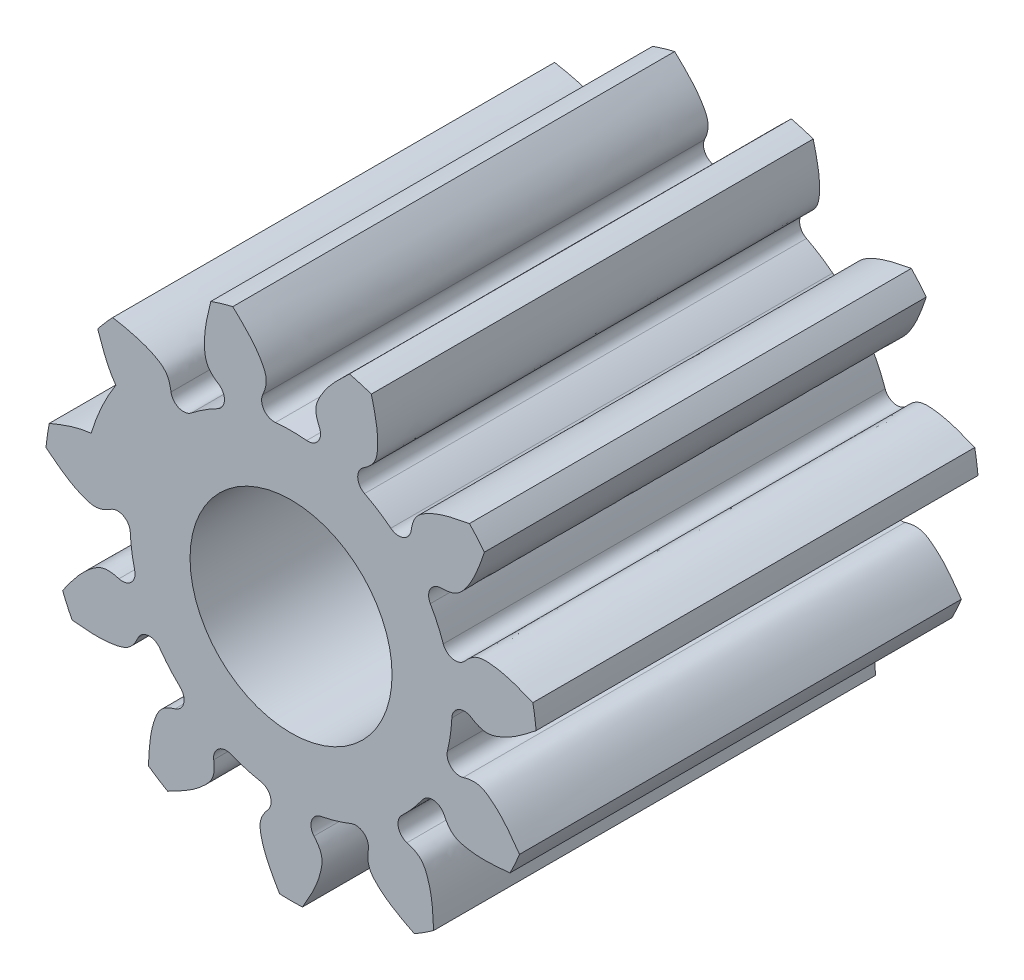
ISO-10303-21;
HEADER;
FILE_DESCRIPTION(('STEP AP214'),'2;1');
FILE_NAME('part.step','',(''),(''),'','','');
FILE_SCHEMA(('AUTOMOTIVE_DESIGN { 1 0 10303 214 1 1 1 1 }'));
ENDSEC;
DATA;
#1=APPLICATION_CONTEXT('core data for automotive mechanical design processes');
#2=APPLICATION_PROTOCOL_DEFINITION('international standard','automotive_design',2000,#1);
#3=PRODUCT_CONTEXT('',#1,'mechanical');
#4=PRODUCT('Part','Part','',(#3));
#5=PRODUCT_RELATED_PRODUCT_CATEGORY('part','',(#4));
#6=PRODUCT_DEFINITION_FORMATION('','',#4);
#7=PRODUCT_DEFINITION_CONTEXT('part definition',#1,'design');
#8=PRODUCT_DEFINITION('design','',#6,#7);
#9=PRODUCT_DEFINITION_SHAPE('','',#8);
#10=(LENGTH_UNIT() NAMED_UNIT(*) SI_UNIT(.MILLI.,.METRE.));
#11=(NAMED_UNIT(*) PLANE_ANGLE_UNIT() SI_UNIT($,.RADIAN.));
#12=(NAMED_UNIT(*) SI_UNIT($,.STERADIAN.) SOLID_ANGLE_UNIT());
#13=UNCERTAINTY_MEASURE_WITH_UNIT(LENGTH_MEASURE(1.E-05),#10,'distance_accuracy_value','');
#14=(GEOMETRIC_REPRESENTATION_CONTEXT(3) GLOBAL_UNCERTAINTY_ASSIGNED_CONTEXT((#13)) GLOBAL_UNIT_ASSIGNED_CONTEXT((#10,
#11,#12)) REPRESENTATION_CONTEXT('',''));
#15=CARTESIAN_POINT('',(0.,0.,0.));
#16=DIRECTION('',(0.,0.,1.));
#17=DIRECTION('',(1.,0.,0.));
#18=AXIS2_PLACEMENT_3D('',#15,#16,#17);
#19=CARTESIAN_POINT('',(0.,0.,17.5));
#20=DIRECTION('',(0.,0.,-1.));
#21=DIRECTION('',(-1.,0.,0.));
#22=AXIS2_PLACEMENT_3D('',#19,#20,#21);
#23=CYLINDRICAL_SURFACE('',#22,6.375);
#24=CARTESIAN_POINT('',(0.,0.,0.));
#25=DIRECTION('',(0.,0.,1.));
#26=DIRECTION('',(1.,0.,0.));
#27=AXIS2_PLACEMENT_3D('',#24,#25,#26);
#28=CIRCLE('',#27,6.375);
#29=CARTESIAN_POINT('',(4.3903110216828,-4.62231480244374,0.));
#30=VERTEX_POINT('',#29);
#31=CARTESIAN_POINT('',(5.19933750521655,-3.6888364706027,0.));
#32=VERTEX_POINT('',#31);
#33=EDGE_CURVE('E1137',#30,#32,#28,.T.);
#34=ORIENTED_EDGE('',*,*,#33,.T.);
#35=DIRECTION('',(0.,0.,-1.));
#36=VECTOR('',#35,1.);
#37=CARTESIAN_POINT('',(5.19933750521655,-3.6888364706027,17.5));
#38=LINE('',#37,#36);
#39=CARTESIAN_POINT('',(5.19933750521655,-3.6888364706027,17.5));
#40=VERTEX_POINT('',#39);
#41=EDGE_CURVE('E56',#32,#40,#38,.F.);
#42=ORIENTED_EDGE('',*,*,#41,.T.);
#43=CARTESIAN_POINT('',(0.,0.,17.5));
#44=DIRECTION('',(0.,0.,1.));
#45=DIRECTION('',(1.,0.,0.));
#46=AXIS2_PLACEMENT_3D('',#43,#44,#45);
#47=CIRCLE('',#46,6.375);
#48=CARTESIAN_POINT('',(4.3903110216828,-4.62231480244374,17.5));
#49=VERTEX_POINT('',#48);
#50=EDGE_CURVE('E834',#49,#40,#47,.T.);
#51=ORIENTED_EDGE('',*,*,#50,.F.);
#52=DIRECTION('',(0.,0.,-1.));
#53=VECTOR('',#52,1.);
#54=CARTESIAN_POINT('',(4.3903110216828,-4.62231480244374,17.5));
#55=LINE('',#54,#53);
#56=EDGE_CURVE('E791',#49,#30,#55,.T.);
#57=ORIENTED_EDGE('',*,*,#56,.T.);
#58=EDGE_LOOP('',(#34,#42,#51,#57));
#59=FACE_BOUND('',#58,.T.);
#60=ADVANCED_FACE('F35',(#59),#23,.T.);
#61=CARTESIAN_POINT('',(6.19237671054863,-1.51495731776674,17.5));
#62=VERTEX_POINT('',#61);
#63=CARTESIAN_POINT('',(6.36829660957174,-0.292272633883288,17.5));
#64=VERTEX_POINT('',#63);
#65=EDGE_CURVE('E639',#62,#64,#47,.T.);
#66=ORIENTED_EDGE('',*,*,#65,.F.);
#67=DIRECTION('',(0.,0.,-1.));
#68=VECTOR('',#67,1.);
#69=CARTESIAN_POINT('',(6.19237671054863,-1.51495731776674,17.5));
#70=LINE('',#69,#68);
#71=CARTESIAN_POINT('',(6.19237671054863,-1.51495731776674,0.));
#72=VERTEX_POINT('',#71);
#73=EDGE_CURVE('E809',#62,#72,#70,.T.);
#74=ORIENTED_EDGE('',*,*,#73,.T.);
#75=CARTESIAN_POINT('',(6.36829660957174,-0.292272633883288,0.));
#76=VERTEX_POINT('',#75);
#77=EDGE_CURVE('E635',#72,#76,#28,.T.);
#78=ORIENTED_EDGE('',*,*,#77,.T.);
#79=DIRECTION('',(0.,0.,-1.));
#80=VECTOR('',#79,1.);
#81=CARTESIAN_POINT('',(6.36829660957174,-0.292272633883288,17.5));
#82=LINE('',#81,#80);
#83=EDGE_CURVE('E644',#76,#64,#82,.F.);
#84=ORIENTED_EDGE('',*,*,#83,.T.);
#85=EDGE_LOOP('',(#66,#74,#78,#84));
#86=FACE_BOUND('',#85,.T.);
#87=ADVANCED_FACE('F830',(#86),#23,.T.);
#88=CARTESIAN_POINT('',(1.19435260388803,-6.26211999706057,0.));
#89=VERTEX_POINT('',#88);
#90=CARTESIAN_POINT('',(2.37962547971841,-5.91422079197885,0.));
#91=VERTEX_POINT('',#90);
#92=EDGE_CURVE('E1139',#89,#91,#28,.T.);
#93=ORIENTED_EDGE('',*,*,#92,.T.);
#94=DIRECTION('',(0.,0.,-1.));
#95=VECTOR('',#94,1.);
#96=CARTESIAN_POINT('',(2.37962547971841,-5.91422079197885,17.5));
#97=LINE('',#96,#95);
#98=CARTESIAN_POINT('',(2.37962547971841,-5.91422079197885,17.5));
#99=VERTEX_POINT('',#98);
#100=EDGE_CURVE('E799',#91,#99,#97,.F.);
#101=ORIENTED_EDGE('',*,*,#100,.T.);
#102=CARTESIAN_POINT('',(1.19435260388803,-6.26211999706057,17.5));
#103=VERTEX_POINT('',#102);
#104=EDGE_CURVE('E1276',#103,#99,#47,.T.);
#105=ORIENTED_EDGE('',*,*,#104,.F.);
#106=DIRECTION('',(0.,0.,-1.));
#107=VECTOR('',#106,1.);
#108=CARTESIAN_POINT('',(1.19435260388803,-6.26211999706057,17.5));
#109=LINE('',#108,#107);
#110=EDGE_CURVE('E773',#103,#89,#109,.T.);
#111=ORIENTED_EDGE('',*,*,#110,.T.);
#112=EDGE_LOOP('',(#93,#101,#105,#111));
#113=FACE_BOUND('',#112,.T.);
#114=ADVANCED_FACE('F1136',(#113),#23,.T.);
#115=CARTESIAN_POINT('',(-2.38080432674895,-5.91374633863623,0.));
#116=VERTEX_POINT('',#115);
#117=CARTESIAN_POINT('',(-1.19560082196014,-6.26188179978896,0.));
#118=VERTEX_POINT('',#117);
#119=EDGE_CURVE('E1411',#116,#118,#28,.T.);
#120=ORIENTED_EDGE('',*,*,#119,.T.);
#121=DIRECTION('',(0.,0.,-1.));
#122=VECTOR('',#121,1.);
#123=CARTESIAN_POINT('',(-1.19560082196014,-6.26188179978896,17.5));
#124=LINE('',#123,#122);
#125=CARTESIAN_POINT('',(-1.19560082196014,-6.26188179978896,17.5));
#126=VERTEX_POINT('',#125);
#127=EDGE_CURVE('E781',#118,#126,#124,.F.);
#128=ORIENTED_EDGE('',*,*,#127,.T.);
#129=CARTESIAN_POINT('',(-2.38080432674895,-5.91374633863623,17.5));
#130=VERTEX_POINT('',#129);
#131=EDGE_CURVE('E1272',#130,#126,#47,.T.);
#132=ORIENTED_EDGE('',*,*,#131,.F.);
#133=DIRECTION('',(0.,0.,-1.));
#134=VECTOR('',#133,1.);
#135=CARTESIAN_POINT('',(-2.38080432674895,-5.91374633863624,17.5));
#136=LINE('',#135,#134);
#137=EDGE_CURVE('E755',#130,#116,#136,.T.);
#138=ORIENTED_EDGE('',*,*,#137,.T.);
#139=EDGE_LOOP('',(#120,#128,#132,#138));
#140=FACE_BOUND('',#139,.T.);
#141=ADVANCED_FACE('F1430',(#140),#23,.T.);
#142=CARTESIAN_POINT('',(-5.20007270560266,-3.68780000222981,0.));
#143=VERTEX_POINT('',#142);
#144=CARTESIAN_POINT('',(-4.39123231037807,-4.62143958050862,0.));
#145=VERTEX_POINT('',#144);
#146=EDGE_CURVE('E1409',#143,#145,#28,.T.);
#147=ORIENTED_EDGE('',*,*,#146,.T.);
#148=DIRECTION('',(0.,0.,-1.));
#149=VECTOR('',#148,1.);
#150=CARTESIAN_POINT('',(-4.39123231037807,-4.62143958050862,17.5));
#151=LINE('',#150,#149);
#152=CARTESIAN_POINT('',(-4.39123231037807,-4.62143958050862,17.5));
#153=VERTEX_POINT('',#152);
#154=EDGE_CURVE('E763',#145,#153,#151,.F.);
#155=ORIENTED_EDGE('',*,*,#154,.T.);
#156=CARTESIAN_POINT('',(-5.20007270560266,-3.68780000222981,17.5));
#157=VERTEX_POINT('',#156);
#158=EDGE_CURVE('E1268',#157,#153,#47,.T.);
#159=ORIENTED_EDGE('',*,*,#158,.F.);
#160=DIRECTION('',(0.,0.,-1.));
#161=VECTOR('',#160,1.);
#162=CARTESIAN_POINT('',(-5.20007270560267,-3.68780000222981,17.5));
#163=LINE('',#162,#161);
#164=EDGE_CURVE('E737',#157,#143,#163,.T.);
#165=ORIENTED_EDGE('',*,*,#164,.T.);
#166=EDGE_LOOP('',(#147,#155,#159,#165));
#167=FACE_BOUND('',#166,.T.);
#168=ADVANCED_FACE('F1444',(#167),#23,.T.);
#169=CARTESIAN_POINT('',(-6.36835474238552,-0.291003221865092,0.));
#170=VERTEX_POINT('',#169);
#171=CARTESIAN_POINT('',(-6.19267856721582,-1.51372294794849,0.));
#172=VERTEX_POINT('',#171);
#173=EDGE_CURVE('E1255',#170,#172,#28,.T.);
#174=ORIENTED_EDGE('',*,*,#173,.T.);
#175=DIRECTION('',(0.,0.,-1.));
#176=VECTOR('',#175,1.);
#177=CARTESIAN_POINT('',(-6.19267856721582,-1.51372294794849,17.5));
#178=LINE('',#177,#176);
#179=CARTESIAN_POINT('',(-6.19267856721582,-1.51372294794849,17.5));
#180=VERTEX_POINT('',#179);
#181=EDGE_CURVE('E745',#172,#180,#178,.F.);
#182=ORIENTED_EDGE('',*,*,#181,.T.);
#183=CARTESIAN_POINT('',(-6.36835474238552,-0.291003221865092,17.5));
#184=VERTEX_POINT('',#183);
#185=EDGE_CURVE('E1265',#184,#180,#47,.T.);
#186=ORIENTED_EDGE('',*,*,#185,.F.);
#187=DIRECTION('',(0.,0.,-1.));
#188=VECTOR('',#187,1.);
#189=CARTESIAN_POINT('',(-6.36835474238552,-0.291003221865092,17.5));
#190=LINE('',#189,#188);
#191=EDGE_CURVE('E728',#184,#170,#190,.T.);
#192=ORIENTED_EDGE('',*,*,#191,.T.);
#193=EDGE_LOOP('',(#174,#182,#186,#192));
#194=FACE_BOUND('',#193,.T.);
#195=ADVANCED_FACE('F1262',(#194),#23,.T.);
#196=CARTESIAN_POINT('',(-2.91021600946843,5.67197212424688,0.));
#197=VERTEX_POINT('',#196);
#198=CARTESIAN_POINT('',(-3.94946247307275,5.00423532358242,0.));
#199=VERTEX_POINT('',#198);
#200=EDGE_CURVE('E1402',#197,#199,#28,.T.);
#201=ORIENTED_EDGE('',*,*,#200,.T.);
#202=DIRECTION('',(0.,0.,-1.));
#203=VECTOR('',#202,1.);
#204=CARTESIAN_POINT('',(-3.94946247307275,5.00423532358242,17.5));
#205=LINE('',#204,#203);
#206=CARTESIAN_POINT('',(-3.94946247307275,5.00423532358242,17.5));
#207=VERTEX_POINT('',#206);
#208=EDGE_CURVE('E722',#199,#207,#205,.F.);
#209=ORIENTED_EDGE('',*,*,#208,.T.);
#210=CARTESIAN_POINT('',(-2.91021600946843,5.67197212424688,17.5));
#211=VERTEX_POINT('',#210);
#212=EDGE_CURVE('E1267',#211,#207,#47,.T.);
#213=ORIENTED_EDGE('',*,*,#212,.F.);
#214=DIRECTION('',(0.,0.,-1.));
#215=VECTOR('',#214,1.);
#216=CARTESIAN_POINT('',(-2.91021600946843,5.67197212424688,17.5));
#217=LINE('',#216,#215);
#218=EDGE_CURVE('E701',#211,#197,#217,.T.);
#219=ORIENTED_EDGE('',*,*,#218,.T.);
#220=EDGE_LOOP('',(#201,#209,#213,#219));
#221=FACE_BOUND('',#220,.T.);
#222=ADVANCED_FACE('F1400',(#221),#23,.T.);
#223=CARTESIAN_POINT('',(0.618270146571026,6.34494814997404,0.));
#224=VERTEX_POINT('',#223);
#225=CARTESIAN_POINT('',(-0.617005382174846,6.34507126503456,0.));
#226=VERTEX_POINT('',#225);
#227=EDGE_CURVE('E1407',#224,#226,#28,.T.);
#228=ORIENTED_EDGE('',*,*,#227,.T.);
#229=DIRECTION('',(0.,0.,-1.));
#230=VECTOR('',#229,1.);
#231=CARTESIAN_POINT('',(-0.617005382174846,6.34507126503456,17.5));
#232=LINE('',#231,#230);
#233=CARTESIAN_POINT('',(-0.617005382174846,6.34507126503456,17.5));
#234=VERTEX_POINT('',#233);
#235=EDGE_CURVE('E709',#226,#234,#232,.F.);
#236=ORIENTED_EDGE('',*,*,#235,.T.);
#237=CARTESIAN_POINT('',(0.618270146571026,6.34494814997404,17.5));
#238=VERTEX_POINT('',#237);
#239=EDGE_CURVE('E1270',#238,#234,#47,.T.);
#240=ORIENTED_EDGE('',*,*,#239,.F.);
#241=DIRECTION('',(0.,0.,-1.));
#242=VECTOR('',#241,1.);
#243=CARTESIAN_POINT('',(0.618270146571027,6.34494814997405,17.5));
#244=LINE('',#243,#242);
#245=EDGE_CURVE('E683',#238,#224,#244,.T.);
#246=ORIENTED_EDGE('',*,*,#245,.T.);
#247=EDGE_LOOP('',(#228,#236,#240,#246));
#248=FACE_BOUND('',#247,.T.);
#249=ADVANCED_FACE('F1803',(#248),#23,.T.);
#250=CARTESIAN_POINT('',(3.95045989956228,5.00344796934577,0.));
#251=VERTEX_POINT('',#250);
#252=CARTESIAN_POINT('',(2.91134655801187,5.67139191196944,0.));
#253=VERTEX_POINT('',#252);
#254=EDGE_CURVE('E640',#251,#253,#28,.T.);
#255=ORIENTED_EDGE('',*,*,#254,.T.);
#256=DIRECTION('',(0.,0.,-1.));
#257=VECTOR('',#256,1.);
#258=CARTESIAN_POINT('',(2.91134655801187,5.67139191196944,17.5));
#259=LINE('',#258,#257);
#260=CARTESIAN_POINT('',(2.91134655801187,5.67139191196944,17.5));
#261=VERTEX_POINT('',#260);
#262=EDGE_CURVE('E691',#253,#261,#259,.F.);
#263=ORIENTED_EDGE('',*,*,#262,.T.);
#264=CARTESIAN_POINT('',(3.95045989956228,5.00344796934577,17.5));
#265=VERTEX_POINT('',#264);
#266=EDGE_CURVE('E645',#265,#261,#47,.T.);
#267=ORIENTED_EDGE('',*,*,#266,.F.);
#268=DIRECTION('',(0.,0.,-1.));
#269=VECTOR('',#268,1.);
#270=CARTESIAN_POINT('',(3.95045989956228,5.00344796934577,17.5));
#271=LINE('',#270,#269);
#272=EDGE_CURVE('E665',#265,#251,#271,.T.);
#273=ORIENTED_EDGE('',*,*,#272,.T.);
#274=EDGE_LOOP('',(#255,#263,#267,#273));
#275=FACE_BOUND('',#274,.T.);
#276=ADVANCED_FACE('F1130',(#275),#23,.T.);
#277=CARTESIAN_POINT('',(6.02840654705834,2.07338841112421,0.));
#278=VERTEX_POINT('',#277);
#279=CARTESIAN_POINT('',(5.51536653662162,3.19708569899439,0.));
#280=VERTEX_POINT('',#279);
#281=EDGE_CURVE('E636',#278,#280,#28,.T.);
#282=ORIENTED_EDGE('',*,*,#281,.T.);
#283=DIRECTION('',(0.,0.,-1.));
#284=VECTOR('',#283,1.);
#285=CARTESIAN_POINT('',(5.51536653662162,3.19708569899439,17.5));
#286=LINE('',#285,#284);
#287=CARTESIAN_POINT('',(5.51536653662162,3.19708569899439,17.5));
#288=VERTEX_POINT('',#287);
#289=EDGE_CURVE('E673',#280,#288,#286,.F.);
#290=ORIENTED_EDGE('',*,*,#289,.T.);
#291=CARTESIAN_POINT('',(6.02840654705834,2.07338841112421,17.5));
#292=VERTEX_POINT('',#291);
#293=EDGE_CURVE('E641',#292,#288,#47,.T.);
#294=ORIENTED_EDGE('',*,*,#293,.F.);
#295=DIRECTION('',(0.,0.,-1.));
#296=VECTOR('',#295,1.);
#297=CARTESIAN_POINT('',(6.02840654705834,2.07338841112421,17.5));
#298=LINE('',#297,#296);
#299=EDGE_CURVE('E648',#292,#278,#298,.T.);
#300=ORIENTED_EDGE('',*,*,#299,.T.);
#301=EDGE_LOOP('',(#282,#290,#294,#300));
#302=FACE_BOUND('',#301,.T.);
#303=ADVANCED_FACE('F37',(#302),#23,.T.);
#304=CARTESIAN_POINT('',(0.,0.,17.5));
#305=DIRECTION('',(0.,0.,1.));
#306=DIRECTION('',(1.,0.,0.));
#307=AXIS2_PLACEMENT_3D('',#304,#305,#306);
#308=PLANE('',#307);
#309=CARTESIAN_POINT('',(-7.65678238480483,6.03623918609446,17.5));
#310=CARTESIAN_POINT('',(-7.47087169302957,5.48995642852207,17.5));
#311=CARTESIAN_POINT('',(-7.22998941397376,4.78214433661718,17.5));
#312=CARTESIAN_POINT('',(-6.41301565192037,3.81892403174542,17.5));
#313=CARTESIAN_POINT('',(-5.60281872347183,4.00081451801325,17.5));
#314=CARTESIAN_POINT('',(-5.0807350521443,3.95351078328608,17.5));
#315=CARTESIAN_POINT('',(-5.00635771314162,3.9467717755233,17.5));
#316=B_SPLINE_CURVE_WITH_KNOTS('',3,(#309,#310,#311,#312,#313,#314,#315),.UNSPECIFIED.,.F.,.F.,
(4,1,1,1,4),(0.,0.452331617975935,0.586080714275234,0.94103202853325,1.),.UNSPECIFIED.);
#317=CARTESIAN_POINT('',(-7.65678238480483,6.03623918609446,17.5));
#318=VERTEX_POINT('',#317);
#319=CARTESIAN_POINT('',(-6.93945242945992,4.46167008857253,17.5));
#320=VERTEX_POINT('',#319);
#321=EDGE_CURVE('E443',#318,#320,#316,.T.);
#322=ORIENTED_EDGE('',*,*,#321,.T.);
#323=CARTESIAN_POINT('',(0.,0.,17.5));
#324=DIRECTION('',(0.,0.,1.));
#325=DIRECTION('',(1.,0.,0.));
#326=AXIS2_PLACEMENT_3D('',#323,#324,#325);
#327=CIRCLE('',#326,8.25);
#328=CARTESIAN_POINT('',(-7.91581703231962,2.32429359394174,17.5));
#329=VERTEX_POINT('',#328);
#330=EDGE_CURVE('E435',#329,#320,#327,.F.);
#331=ORIENTED_EDGE('',*,*,#330,.F.);
#332=CARTESIAN_POINT('',(-6.26099905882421,1.2002148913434,17.5));
#333=CARTESIAN_POINT('',(-6.31478853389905,1.25202314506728,17.5));
#334=CARTESIAN_POINT('',(-6.69235792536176,1.61568556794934,17.5));
#335=CARTESIAN_POINT('',(-7.08531461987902,2.34718283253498,17.5));
#336=CARTESIAN_POINT('',(-8.34827462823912,2.33408699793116,17.5));
#337=CARTESIAN_POINT('',(-9.04100375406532,2.05275340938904,17.5));
#338=CARTESIAN_POINT('',(-9.57564561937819,1.83562277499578,17.5));
#339=B_SPLINE_CURVE_WITH_KNOTS('',3,(#332,#333,#334,#335,#336,#337,#338),.UNSPECIFIED.,.F.,.F.,
(4,1,1,1,4),(0.,0.0589679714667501,0.413919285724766,0.547668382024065,1.),.UNSPECIFIED.);
#340=CARTESIAN_POINT('',(-9.57564561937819,1.83562277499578,17.5));
#341=VERTEX_POINT('',#340);
#342=EDGE_CURVE('E440',#329,#341,#339,.T.);
#343=ORIENTED_EDGE('',*,*,#342,.T.);
#344=CARTESIAN_POINT('',(0.,0.,17.5));
#345=DIRECTION('',(0.,0.,1.));
#346=DIRECTION('',(-0.959492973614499,0.281732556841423,0.));
#347=AXIS2_PLACEMENT_3D('',#344,#345,#346);
#348=CIRCLE('',#347,9.75);
#349=CARTESIAN_POINT('',(-9.70473251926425,0.938438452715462,17.5));
#350=VERTEX_POINT('',#349);
#351=EDGE_CURVE('E460',#341,#350,#348,.T.);
#352=ORIENTED_EDGE('',*,*,#351,.T.);
#353=CARTESIAN_POINT('',(-9.70473251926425,0.938438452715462,17.5));
#354=CARTESIAN_POINT('',(-9.25299173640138,0.579387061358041,17.5));
#355=CARTESIAN_POINT('',(-8.66767656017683,0.114168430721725,17.5));
#356=CARTESIAN_POINT('',(-7.45963828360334,-0.254454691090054,17.5));
#357=CARTESIAN_POINT('',(-6.87639467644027,0.33658685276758,17.5));
#358=CARTESIAN_POINT('',(-6.41161561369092,0.579052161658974,17.5));
#359=CARTESIAN_POINT('',(-6.34540203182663,0.613594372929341,17.5));
#360=B_SPLINE_CURVE_WITH_KNOTS('',3,(#353,#354,#355,#356,#357,#358,#359),.UNSPECIFIED.,.F.,.F.,
(4,1,1,1,4),(0.,0.452331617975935,0.586080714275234,0.94103202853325,1.),.UNSPECIFIED.);
#361=CARTESIAN_POINT('',(-7.13476361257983,0.108959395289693,17.5));
#362=VERTEX_POINT('',#361);
#363=EDGE_CURVE('E463',#350,#362,#360,.T.);
#364=ORIENTED_EDGE('',*,*,#363,.T.);
#365=CARTESIAN_POINT('',(-6.86783354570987,-0.313827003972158,17.5));
#366=DIRECTION('',(0.,0.,1.));
#367=DIRECTION('',(1.,0.,0.));
#368=AXIS2_PLACEMENT_3D('',#365,#366,#367);
#369=CIRCLE('',#368,0.5);
#370=EDGE_CURVE('E735',#362,#184,#369,.F.);
#371=ORIENTED_EDGE('',*,*,#370,.T.);
#372=ORIENTED_EDGE('',*,*,#185,.T.);
#373=CARTESIAN_POINT('',(-6.67837884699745,-1.63244631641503,17.5));
#374=DIRECTION('',(0.,0.,1.));
#375=DIRECTION('',(1.,0.,0.));
#376=AXIS2_PLACEMENT_3D('',#373,#374,#375);
#377=CIRCLE('',#376,0.5);
#378=CARTESIAN_POINT('',(-6.81547952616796,-2.11328246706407,17.5));
#379=VERTEX_POINT('',#378);
#380=EDGE_CURVE('E753',#180,#379,#377,.F.);
#381=ORIENTED_EDGE('',*,*,#380,.T.);
#382=CARTESIAN_POINT('',(-5.91597273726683,-2.37526663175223,17.5));
#383=CARTESIAN_POINT('',(-5.98923297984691,-2.36076354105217,17.5));
#384=CARTESIAN_POINT('',(-6.50347531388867,-2.2589606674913,17.5));
#385=CARTESIAN_POINT('',(-7.2295288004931,-1.85603443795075,17.5));
#386=CARTESIAN_POINT('',(-8.28491822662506,-2.54985908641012,17.5));
#387=CARTESIAN_POINT('',(-8.71557862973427,-3.16104960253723,17.5));
#388=CARTESIAN_POINT('',(-9.04795830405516,-3.63276073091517,17.5));
#389=B_SPLINE_CURVE_WITH_KNOTS('',3,(#382,#383,#384,#385,#386,#387,#388),.UNSPECIFIED.,.F.,.F.,
(4,1,1,1,4),(0.,0.0589679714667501,0.413919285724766,0.547668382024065,1.),.UNSPECIFIED.);
#390=CARTESIAN_POINT('',(-9.04795830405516,-3.63276073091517,17.5));
#391=VERTEX_POINT('',#390);
#392=EDGE_CURVE('E975',#379,#391,#389,.T.);
#393=ORIENTED_EDGE('',*,*,#392,.T.);
#394=CARTESIAN_POINT('',(0.,0.,17.5));
#395=DIRECTION('',(0.,0.,1.));
#396=DIRECTION('',(-0.959492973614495,-0.281732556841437,0.));
#397=AXIS2_PLACEMENT_3D('',#394,#395,#396);
#398=CIRCLE('',#397,9.75);
#399=CARTESIAN_POINT('',(-8.67149864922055,-4.45730985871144,17.5));
#400=VERTEX_POINT('',#399);
#401=EDGE_CURVE('E983',#391,#400,#398,.T.);
#402=ORIENTED_EDGE('',*,*,#401,.T.);
#403=CARTESIAN_POINT('',(-8.67149864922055,-4.45730985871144,17.5));
#404=CARTESIAN_POINT('',(-8.09735228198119,-4.51513360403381,17.5));
#405=CARTESIAN_POINT('',(-7.35343764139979,-4.59005514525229,17.5));
#406=CARTESIAN_POINT('',(-6.1378784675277,-4.24704584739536,17.5));
#407=CARTESIAN_POINT('',(-5.96676390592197,-3.43450476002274,17.5));
#408=CARTESIAN_POINT('',(-5.70685352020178,-2.97925142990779,17.5));
#409=CARTESIAN_POINT('',(-5.66982603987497,-2.91439490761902,17.5));
#410=B_SPLINE_CURVE_WITH_KNOTS('',3,(#403,#404,#405,#406,#407,#408,#409),.UNSPECIFIED.,.F.,.F.,
(4,1,1,1,4),(0.,0.452331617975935,0.586080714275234,0.94103202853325,1.),.UNSPECIFIED.);
#411=CARTESIAN_POINT('',(-6.06105299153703,-3.76568195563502,17.5));
#412=VERTEX_POINT('',#411);
#413=EDGE_CURVE('E1226',#400,#412,#410,.T.);
#414=ORIENTED_EDGE('',*,*,#413,.T.);
#415=CARTESIAN_POINT('',(-5.60792154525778,-3.97703921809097,17.5));
#416=DIRECTION('',(0.,0.,1.));
#417=DIRECTION('',(1.,0.,0.));
#418=AXIS2_PLACEMENT_3D('',#415,#416,#417);
#419=CIRCLE('',#418,0.5);
#420=EDGE_CURVE('E749',#412,#157,#419,.F.);
#421=ORIENTED_EDGE('',*,*,#420,.T.);
#422=ORIENTED_EDGE('',*,*,#158,.T.);
#423=CARTESIAN_POINT('',(-4.73564268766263,-4.98390542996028,17.5));
#424=DIRECTION('',(0.,0.,1.));
#425=DIRECTION('',(1.,0.,0.));
#426=AXIS2_PLACEMENT_3D('',#423,#424,#425);
#427=CIRCLE('',#426,0.5);
#428=CARTESIAN_POINT('',(-4.59101946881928,-5.46253276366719,17.5));
#429=VERTEX_POINT('',#428);
#430=EDGE_CURVE('E771',#153,#429,#427,.F.);
#431=ORIENTED_EDGE('',*,*,#430,.T.);
#432=CARTESIAN_POINT('',(-3.69266687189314,-5.19661778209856,17.5));
#433=CARTESIAN_POINT('',(-3.76213827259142,-5.22402448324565,17.5));
#434=CARTESIAN_POINT('',(-4.24978524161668,-5.41640285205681,17.5));
#435=CARTESIAN_POINT('',(-5.07841866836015,-5.46997388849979,17.5));
#436=CARTESIAN_POINT('',(-5.59115882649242,-6.62424292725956,17.5));
#437=CARTESIAN_POINT('',(-5.62301887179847,-7.37124170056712,17.5));
#438=CARTESIAN_POINT('',(-5.64760815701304,-7.94776837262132,17.5));
#439=B_SPLINE_CURVE_WITH_KNOTS('',3,(#432,#433,#434,#435,#436,#437,#438),.UNSPECIFIED.,.F.,.F.,
(4,1,1,1,4),(0.,0.0589679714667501,0.413919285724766,0.547668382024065,1.),.UNSPECIFIED.);
#440=CARTESIAN_POINT('',(-5.64760815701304,-7.94776837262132,17.5));
#441=VERTEX_POINT('',#440);
#442=EDGE_CURVE('E1210',#429,#441,#439,.T.);
#443=ORIENTED_EDGE('',*,*,#442,.T.);
#444=CARTESIAN_POINT('',(0.,0.,17.5));
#445=DIRECTION('',(0.,0.,1.));
#446=DIRECTION('',(-0.654860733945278,-0.755749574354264,0.));
#447=AXIS2_PLACEMENT_3D('',#444,#445,#446);
#448=CIRCLE('',#447,9.75);
#449=CARTESIAN_POINT('',(-4.88512522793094,-8.43789378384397,17.5));
#450=VERTEX_POINT('',#449);
#451=EDGE_CURVE('E951',#441,#450,#448,.T.);
#452=ORIENTED_EDGE('',*,*,#451,.T.);
#453=CARTESIAN_POINT('',(-4.88512522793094,-8.43789378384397,17.5));
#454=CARTESIAN_POINT('',(-4.37086069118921,-8.17613125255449,17.5));
#455=CARTESIAN_POINT('',(-3.70453422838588,-7.83696864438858,17.5));
#456=CARTESIAN_POINT('',(-2.86738560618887,-6.89122995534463,17.5));
#457=CARTESIAN_POINT('',(-3.1627277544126,-6.11516537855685,17.5));
#458=CARTESIAN_POINT('',(-3.1902057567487,-5.59166374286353,17.5));
#459=CARTESIAN_POINT('',(-3.19412034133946,-5.51708439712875,17.5));
#460=B_SPLINE_CURVE_WITH_KNOTS('',3,(#453,#454,#455,#456,#457,#458,#459),.UNSPECIFIED.,.F.,.F.,
(4,1,1,1,4),(0.,0.452331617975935,0.586080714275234,0.94103202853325,1.),.UNSPECIFIED.);
#461=CARTESIAN_POINT('',(-3.0630008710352,-6.44474589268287,17.5));
#462=VERTEX_POINT('',#461);
#463=EDGE_CURVE('E943',#450,#462,#460,.T.);
#464=ORIENTED_EDGE('',*,*,#463,.T.);
#465=CARTESIAN_POINT('',(-2.56753407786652,-6.37756958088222,17.5));
#466=DIRECTION('',(0.,0.,1.));
#467=DIRECTION('',(1.,0.,0.));
#468=AXIS2_PLACEMENT_3D('',#465,#466,#467);
#469=CIRCLE('',#468,0.5);
#470=EDGE_CURVE('E767',#462,#130,#469,.F.);
#471=ORIENTED_EDGE('',*,*,#470,.T.);
#472=ORIENTED_EDGE('',*,*,#131,.T.);
#473=CARTESIAN_POINT('',(-1.28937343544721,-6.75300978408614,17.5));
#474=DIRECTION('',(0.,0.,1.));
#475=DIRECTION('',(1.,0.,0.));
#476=AXIS2_PLACEMENT_3D('',#473,#474,#475);
#477=CIRCLE('',#476,0.5);
#478=CARTESIAN_POINT('',(-0.908943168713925,-7.07746750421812,17.5));
#479=VERTEX_POINT('',#478);
#480=EDGE_CURVE('E789',#126,#479,#477,.F.);
#481=ORIENTED_EDGE('',*,*,#480,.T.);
#482=CARTESIAN_POINT('',(-0.296965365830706,-6.36807950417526,17.5));
#483=CARTESIAN_POINT('',(-0.340591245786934,-6.4286945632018,17.5));
#484=CARTESIAN_POINT('',(-0.646818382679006,-6.85417540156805,17.5));
#485=CARTESIAN_POINT('',(-1.31494649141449,-7.34723527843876,17.5));
#486=CARTESIAN_POINT('',(-1.1222460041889,-8.59547644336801,17.5));
#487=CARTESIAN_POINT('',(-0.745190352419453,-9.24111664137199,17.5));
#488=CARTESIAN_POINT('',(-0.454182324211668,-9.73941571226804,17.5));
#489=B_SPLINE_CURVE_WITH_KNOTS('',3,(#482,#483,#484,#485,#486,#487,#488),.UNSPECIFIED.,.F.,.F.,
(4,1,1,1,4),(0.,0.0589679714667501,0.413919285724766,0.547668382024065,1.),.UNSPECIFIED.);
#490=CARTESIAN_POINT('',(-0.454182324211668,-9.73941571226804,17.5));
#491=VERTEX_POINT('',#490);
#492=EDGE_CURVE('E915',#479,#491,#489,.T.);
#493=ORIENTED_EDGE('',*,*,#492,.T.);
#494=CARTESIAN_POINT('',(0.,0.,17.5));
#495=DIRECTION('',(0.,0.,1.));
#496=DIRECTION('',(-0.142314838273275,-0.989821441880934,0.));
#497=AXIS2_PLACEMENT_3D('',#494,#495,#496);
#498=CIRCLE('',#497,9.75);
#499=CARTESIAN_POINT('',(0.45224093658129,-9.73950605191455,17.5));
#500=VERTEX_POINT('',#499);
#501=EDGE_CURVE('E923',#491,#500,#498,.T.);
#502=ORIENTED_EDGE('',*,*,#501,.T.);
#503=CARTESIAN_POINT('',(0.45224093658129,-9.73950605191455,17.5));
#504=CARTESIAN_POINT('',(0.74334828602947,-9.24126499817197,17.5));
#505=CARTESIAN_POINT('',(1.12053262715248,-8.59569997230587,17.5));
#506=CARTESIAN_POINT('',(1.31348192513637,-7.3474972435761,17.5));
#507=CARTESIAN_POINT('',(0.645452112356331,-6.85430419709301,17.5));
#508=CARTESIAN_POINT('',(0.339309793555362,-6.42876232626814,17.5));
#509=CARTESIAN_POINT('',(0.295695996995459,-6.36813857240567,17.5));
#510=B_SPLINE_CURVE_WITH_KNOTS('',3,(#503,#504,#505,#506,#507,#508,#509),.UNSPECIFIED.,.F.,.F.,
(4,1,1,1,4),(0.,0.452331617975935,0.586080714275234,0.94103202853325,1.),.UNSPECIFIED.);
#511=CARTESIAN_POINT('',(0.907532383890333,-7.07764854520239,17.5));
#512=VERTEX_POINT('',#511);
#513=EDGE_CURVE('E1182',#500,#512,#510,.T.);
#514=ORIENTED_EDGE('',*,*,#513,.T.);
#515=CARTESIAN_POINT('',(1.28802731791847,-6.7532666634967,17.5));
#516=DIRECTION('',(0.,0.,1.));
#517=DIRECTION('',(1.,0.,0.));
#518=AXIS2_PLACEMENT_3D('',#515,#516,#517);
#519=CIRCLE('',#518,0.5);
#520=EDGE_CURVE('E785',#512,#103,#519,.F.);
#521=ORIENTED_EDGE('',*,*,#520,.T.);
#522=ORIENTED_EDGE('',*,*,#104,.T.);
#523=CARTESIAN_POINT('',(2.56626277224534,-6.3780812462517,17.5));
#524=DIRECTION('',(0.,0.,1.));
#525=DIRECTION('',(1.,0.,0.));
#526=AXIS2_PLACEMENT_3D('',#523,#524,#525);
#527=CIRCLE('',#526,0.5);
#528=CARTESIAN_POINT('',(3.06171616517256,-6.44535631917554,17.5));
#529=VERTEX_POINT('',#528);
#530=EDGE_CURVE('E807',#99,#529,#527,.F.);
#531=ORIENTED_EDGE('',*,*,#530,.T.);
#532=CARTESIAN_POINT('',(3.19302054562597,-5.51772097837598,17.5));
#533=CARTESIAN_POINT('',(3.18909109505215,-5.59229954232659,17.5));
#534=CARTESIAN_POINT('',(3.16150874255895,-6.11579569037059,17.5));
#535=CARTESIAN_POINT('',(2.86601190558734,-6.89180138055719,17.5));
#536=CARTESIAN_POINT('',(3.70297199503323,-7.8377069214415,17.5));
#537=CARTESIAN_POINT('',(4.36923083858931,-8.17700234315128,17.5));
#538=CARTESIAN_POINT('',(4.88344318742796,-8.43886737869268,17.5));
#539=B_SPLINE_CURVE_WITH_KNOTS('',3,(#532,#533,#534,#535,#536,#537,#538),.UNSPECIFIED.,.F.,.F.,
(4,1,1,1,4),(0.,0.0589679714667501,0.413919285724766,0.547668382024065,1.),.UNSPECIFIED.);
#540=CARTESIAN_POINT('',(4.88344318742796,-8.43886737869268,17.5));
#541=VERTEX_POINT('',#540);
#542=EDGE_CURVE('E1166',#529,#541,#539,.T.);
#543=ORIENTED_EDGE('',*,*,#542,.T.);
#544=CARTESIAN_POINT('',(0.,0.,17.5));
#545=DIRECTION('',(0.,0.,1.));
#546=DIRECTION('',(0.415415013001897,-0.909631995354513,0.));
#547=AXIS2_PLACEMENT_3D('',#544,#545,#546);
#548=CIRCLE('',#547,9.75);
#549=CARTESIAN_POINT('',(5.64602379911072,-7.94889396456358,17.5));
#550=VERTEX_POINT('',#549);
#551=EDGE_CURVE('E891',#541,#550,#548,.T.);
#552=ORIENTED_EDGE('',*,*,#551,.T.);
#553=CARTESIAN_POINT('',(5.64602379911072,-7.94889396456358,17.5));
#554=CARTESIAN_POINT('',(5.6215494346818,-7.37236240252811,17.5));
#555=CARTESIAN_POINT('',(5.58983829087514,-6.62535729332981,17.5));
#556=CARTESIAN_POINT('',(5.07732822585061,-5.47098607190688,17.5));
#557=CARTESIAN_POINT('',(4.24870549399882,-5.41724986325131,17.5));
#558=CARTESIAN_POINT('',(3.76109688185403,-5.22477429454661,17.5));
#559=CARTESIAN_POINT('',(3.6916309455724,-5.1973537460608,17.5));
#560=B_SPLINE_CURVE_WITH_KNOTS('',3,(#553,#554,#555,#556,#557,#558,#559),.UNSPECIFIED.,.F.,.F.,
(4,1,1,1,4),(0.,0.452331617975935,0.586080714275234,0.94103202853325,1.),.UNSPECIFIED.);
#561=CARTESIAN_POINT('',(4.58993051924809,-5.46344779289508,17.5));
#562=VERTEX_POINT('',#561);
#563=EDGE_CURVE('E883',#550,#562,#560,.T.);
#564=ORIENTED_EDGE('',*,*,#563,.T.);
#565=CARTESIAN_POINT('',(4.73464914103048,-4.98484929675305,17.5));
#566=DIRECTION('',(0.,0.,1.));
#567=DIRECTION('',(1.,0.,0.));
#568=AXIS2_PLACEMENT_3D('',#565,#566,#567);
#569=CIRCLE('',#568,0.5);
#570=EDGE_CURVE('E803',#562,#49,#569,.F.);
#571=ORIENTED_EDGE('',*,*,#570,.T.);
#572=ORIENTED_EDGE('',*,*,#50,.T.);
#573=CARTESIAN_POINT('',(5.60712868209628,-3.97815697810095,17.5));
#574=DIRECTION('',(0.,0.,1.));
#575=DIRECTION('',(1.,0.,0.));
#576=AXIS2_PLACEMENT_3D('',#573,#574,#575);
#577=CIRCLE('',#576,0.5);
#578=CARTESIAN_POINT('',(6.06030224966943,-3.76689004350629,17.5));
#579=VERTEX_POINT('',#578);
#580=EDGE_CURVE('E11',#40,#579,#577,.F.);
#581=ORIENTED_EDGE('',*,*,#580,.T.);
#582=CARTESIAN_POINT('',(5.66924499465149,-2.91552502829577,17.5));
#583=CARTESIAN_POINT('',(5.7062595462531,-2.98038893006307,17.5));
#584=CARTESIAN_POINT('',(5.96607918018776,-3.43569405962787,17.5));
#585=CARTESIAN_POINT('',(6.13703177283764,-4.24826923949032,17.5));
#586=CARTESIAN_POINT('',(7.35252254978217,-4.5915208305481,17.5));
#587=CARTESIAN_POINT('',(8.09645210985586,-4.51674757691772,17.5));
#588=CARTESIAN_POINT('',(8.67060999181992,-4.45903827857,17.5));
#589=B_SPLINE_CURVE_WITH_KNOTS('',3,(#582,#583,#584,#585,#586,#587,#588),.UNSPECIFIED.,.F.,.F.,
(4,1,1,1,4),(0.,0.0589679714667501,0.413919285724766,0.547668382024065,1.),.UNSPECIFIED.);
#590=CARTESIAN_POINT('',(8.67060999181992,-4.45903827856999,17.5));
#591=VERTEX_POINT('',#590);
#592=EDGE_CURVE('E847',#579,#591,#589,.T.);
#593=ORIENTED_EDGE('',*,*,#592,.T.);
#594=CARTESIAN_POINT('',(0.,0.,17.5));
#595=DIRECTION('',(0.,0.,1.));
#596=DIRECTION('',(0.841253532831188,-0.540640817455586,0.));
#597=AXIS2_PLACEMENT_3D('',#594,#595,#596);
#598=CIRCLE('',#597,9.75);
#599=CARTESIAN_POINT('',(9.04723399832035,-3.63456420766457,17.5));
#600=VERTEX_POINT('',#599);
#601=EDGE_CURVE('E850',#591,#600,#598,.T.);
#602=ORIENTED_EDGE('',*,*,#601,.T.);
#603=CARTESIAN_POINT('',(9.04723399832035,-3.63456420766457,17.5));
#604=CARTESIAN_POINT('',(8.71494835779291,-3.16278683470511,17.5));
#605=CARTESIAN_POINT('',(8.28440979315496,-2.55151048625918,17.5));
#606=CARTESIAN_POINT('',(7.22915868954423,-1.85747547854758,17.5));
#607=CARTESIAN_POINT('',(6.50302490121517,-2.26025697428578,17.5));
#608=CARTESIAN_POINT('',(5.98876228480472,-2.36195734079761,17.5));
#609=CARTESIAN_POINT('',(5.91549915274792,-2.37644582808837,17.5));
#610=B_SPLINE_CURVE_WITH_KNOTS('',3,(#603,#604,#605,#606,#607,#608,#609),.UNSPECIFIED.,.F.,.F.,
(4,1,1,1,4),(0.,0.452331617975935,0.586080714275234,0.94103202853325,1.),.UNSPECIFIED.);
#611=CARTESIAN_POINT('',(6.81505814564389,-2.11464096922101,17.5));
#612=VERTEX_POINT('',#611);
#613=EDGE_CURVE('E825',#600,#612,#610,.T.);
#614=ORIENTED_EDGE('',*,*,#613,.T.);
#615=CARTESIAN_POINT('',(6.67805331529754,-1.63377749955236,17.5));
#616=DIRECTION('',(0.,0.,1.));
#617=DIRECTION('',(1.,0.,0.));
#618=AXIS2_PLACEMENT_3D('',#615,#616,#617);
#619=CIRCLE('',#618,0.5);
#620=EDGE_CURVE('E820',#612,#62,#619,.F.);
#621=ORIENTED_EDGE('',*,*,#620,.T.);
#622=ORIENTED_EDGE('',*,*,#65,.T.);
#623=CARTESIAN_POINT('',(6.86777085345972,-0.315195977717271,17.5));
#624=DIRECTION('',(0.,0.,1.));
#625=DIRECTION('',(1.,0.,0.));
#626=AXIS2_PLACEMENT_3D('',#623,#624,#625);
#627=CIRCLE('',#626,0.5);
#628=CARTESIAN_POINT('',(7.13478518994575,0.107537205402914,17.5));
#629=VERTEX_POINT('',#628);
#630=EDGE_CURVE('E663',#64,#629,#627,.F.);
#631=ORIENTED_EDGE('',*,*,#630,.T.);
#632=CARTESIAN_POINT('',(6.34552421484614,0.612329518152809,17.5));
#633=CARTESIAN_POINT('',(6.41173091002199,0.577774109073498,17.5));
#634=CARTESIAN_POINT('',(6.87646163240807,0.335216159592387,17.5));
#635=CARTESIAN_POINT('',(7.45958741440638,-0.255941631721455,17.5));
#636=CARTESIAN_POINT('',(8.6676991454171,0.112440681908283,17.5));
#637=CARTESIAN_POINT('',(9.2531070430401,0.577542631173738,17.5));
#638=CARTESIAN_POINT('',(9.70491938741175,0.93650396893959,17.5));
#639=B_SPLINE_CURVE_WITH_KNOTS('',3,(#632,#633,#634,#635,#636,#637,#638),.UNSPECIFIED.,.F.,.F.,
(4,1,1,1,4),(0.,0.0589679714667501,0.413919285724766,0.547668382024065,1.),.UNSPECIFIED.);
#640=CARTESIAN_POINT('',(9.70491938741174,0.93650396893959,17.5));
#641=VERTEX_POINT('',#640);
#642=EDGE_CURVE('E1111',#629,#641,#639,.T.);
#643=ORIENTED_EDGE('',*,*,#642,.T.);
#644=CARTESIAN_POINT('',(0.,0.,17.5));
#645=DIRECTION('',(0.,0.,1.));
#646=DIRECTION('',(1.,0.,0.));
#647=AXIS2_PLACEMENT_3D('',#644,#645,#646);
#648=CIRCLE('',#647,9.75);
#649=CARTESIAN_POINT('',(9.57601132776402,1.83371400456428,17.5));
#650=VERTEX_POINT('',#649);
#651=EDGE_CURVE('E625',#641,#650,#648,.T.);
#652=ORIENTED_EDGE('',*,*,#651,.T.);
#653=CARTESIAN_POINT('',(9.57601132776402,1.83371400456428,17.5));
#654=CARTESIAN_POINT('',(9.04141275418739,2.05095120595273,17.5));
#655=CARTESIAN_POINT('',(8.34873972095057,2.332422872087,17.5));
#656=CARTESIAN_POINT('',(7.08578234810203,2.34577045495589,17.5));
#657=CARTESIAN_POINT('',(6.69267985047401,1.61435153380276,17.5));
#658=CARTESIAN_POINT('',(6.31503797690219,1.25076437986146,17.5));
#659=CARTESIAN_POINT('',(6.26123817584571,1.19896684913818,17.5));
#660=B_SPLINE_CURVE_WITH_KNOTS('',3,(#653,#654,#655,#656,#657,#658,#659),.UNSPECIFIED.,.F.,.F.,
(4,1,1,1,4),(0.,0.452331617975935,0.586080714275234,0.94103202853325,1.),.UNSPECIFIED.);
#661=CARTESIAN_POINT('',(6.87645296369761,1.90554942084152,17.5));
#662=VERTEX_POINT('',#661);
#663=EDGE_CURVE('E617',#650,#662,#660,.T.);
#664=ORIENTED_EDGE('',*,*,#663,.T.);
#665=CARTESIAN_POINT('',(6.50122274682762,2.23600711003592,17.5));
#666=DIRECTION('',(0.,0.,1.));
#667=DIRECTION('',(1.,0.,0.));
#668=AXIS2_PLACEMENT_3D('',#665,#666,#667);
#669=CIRCLE('',#668,0.5);
#670=EDGE_CURVE('E658',#662,#292,#669,.F.);
#671=ORIENTED_EDGE('',*,*,#670,.T.);
#672=ORIENTED_EDGE('',*,*,#293,.T.);
#673=CARTESIAN_POINT('',(5.94794430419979,3.44783751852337,17.5));
#674=DIRECTION('',(0.,0.,1.));
#675=DIRECTION('',(1.,0.,0.));
#676=AXIS2_PLACEMENT_3D('',#673,#674,#675);
#677=CIRCLE('',#676,0.5);
#678=CARTESIAN_POINT('',(5.94402424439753,3.94782215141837,17.5));
#679=VERTEX_POINT('',#678);
#680=EDGE_CURVE('E681',#288,#679,#677,.F.);
#681=ORIENTED_EDGE('',*,*,#680,.T.);
#682=CARTESIAN_POINT('',(5.00714433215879,3.94577376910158,17.5));
#683=CARTESIAN_POINT('',(5.0815230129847,3.95249795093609,17.5));
#684=CARTESIAN_POINT('',(5.603616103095,3.99969761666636,17.5));
#685=CARTESIAN_POINT('',(6.41377675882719,3.81764563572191,17.5));
#686=CARTESIAN_POINT('',(7.23094250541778,4.78070307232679,17.5));
#687=CARTESIAN_POINT('',(7.47196586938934,5.48846713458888,17.5));
#688=CARTESIAN_POINT('',(7.65798544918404,6.03471282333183,17.5));
#689=B_SPLINE_CURVE_WITH_KNOTS('',3,(#682,#683,#684,#685,#686,#687,#688),.UNSPECIFIED.,.F.,.F.,
(4,1,1,1,4),(0.,0.0589679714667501,0.413919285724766,0.547668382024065,1.),.UNSPECIFIED.);
#690=CARTESIAN_POINT('',(7.65798544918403,6.03471282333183,17.5));
#691=VERTEX_POINT('',#690);
#692=EDGE_CURVE('E581',#679,#691,#689,.T.);
#693=ORIENTED_EDGE('',*,*,#692,.T.);
#694=CARTESIAN_POINT('',(0.,0.,17.5));
#695=DIRECTION('',(0.,0.,1.));
#696=DIRECTION('',(0.841253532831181,0.540640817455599,0.));
#697=AXIS2_PLACEMENT_3D('',#694,#695,#696);
#698=CIRCLE('',#697,9.75);
#699=CARTESIAN_POINT('',(7.06447272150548,6.71980097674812,17.5));
#700=VERTEX_POINT('',#699);
#701=EDGE_CURVE('E589',#691,#700,#698,.T.);
#702=ORIENTED_EDGE('',*,*,#701,.T.);
#703=CARTESIAN_POINT('',(7.06447272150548,6.71980097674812,17.5));
#704=CARTESIAN_POINT('',(6.49729248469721,6.61352673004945,17.5));
#705=CARTESIAN_POINT('',(5.76240377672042,6.47582844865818,17.5));
#706=CARTESIAN_POINT('',(4.69272017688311,5.80425084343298,17.5));
#707=CARTESIAN_POINT('',(4.75745623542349,4.97641483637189,17.5));
#708=CARTESIAN_POINT('',(4.63633373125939,4.4663772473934,17.5));
#709=CARTESIAN_POINT('',(4.61907831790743,4.39371602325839,17.5));
#710=B_SPLINE_CURVE_WITH_KNOTS('',3,(#703,#704,#705,#706,#707,#708,#709),.UNSPECIFIED.,.F.,.F.,
(4,1,1,1,4),(0.,0.452331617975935,0.586080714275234,0.94103202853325,1.),.UNSPECIFIED.);
#711=CARTESIAN_POINT('',(4.75462255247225,5.32074133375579,17.5));
#712=VERTEX_POINT('',#711);
#713=EDGE_CURVE('E1083',#700,#712,#710,.T.);
#714=ORIENTED_EDGE('',*,*,#713,.T.);
#715=CARTESIAN_POINT('',(4.26029989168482,5.39587526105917,17.5));
#716=DIRECTION('',(0.,0.,1.));
#717=DIRECTION('',(1.,0.,0.));
#718=AXIS2_PLACEMENT_3D('',#715,#716,#717);
#719=CIRCLE('',#718,0.5);
#720=EDGE_CURVE('E677',#712,#265,#719,.F.);
#721=ORIENTED_EDGE('',*,*,#720,.T.);
#722=ORIENTED_EDGE('',*,*,#266,.T.);
#723=CARTESIAN_POINT('',(3.13968746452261,6.11620696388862,17.5));
#724=DIRECTION('',(0.,0.,1.));
#725=DIRECTION('',(1.,0.,0.));
#726=AXIS2_PLACEMENT_3D('',#723,#724,#725);
#727=CIRCLE('',#726,0.5);
#728=CARTESIAN_POINT('',(2.86607759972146,6.53470145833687,17.5));
#729=VERTEX_POINT('',#728);
#730=EDGE_CURVE('E699',#261,#729,#727,.F.);
#731=ORIENTED_EDGE('',*,*,#730,.T.);
#732=CARTESIAN_POINT('',(2.07903150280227,6.0264627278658,17.5));
#733=CARTESIAN_POINT('',(2.13796746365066,6.07233162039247,17.5));
#734=CARTESIAN_POINT('',(2.55166205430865,6.39430334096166,17.5));
#735=CARTESIAN_POINT('',(3.3316372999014,6.67915738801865,17.5));
#736=CARTESIAN_POINT('',(3.49841271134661,7.93112601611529,17.5));
#737=CARTESIAN_POINT('',(3.31852832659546,8.6568421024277,17.5));
#738=CARTESIAN_POINT('',(3.17969523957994,9.21694299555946,17.5));
#739=B_SPLINE_CURVE_WITH_KNOTS('',3,(#732,#733,#734,#735,#736,#737,#738),.UNSPECIFIED.,.F.,.F.,
(4,1,1,1,4),(0.,0.0589679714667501,0.413919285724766,0.547668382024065,1.),.UNSPECIFIED.);
#740=CARTESIAN_POINT('',(3.17969523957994,9.21694299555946,17.5));
#741=VERTEX_POINT('',#740);
#742=EDGE_CURVE('E1067',#729,#741,#739,.T.);
#743=ORIENTED_EDGE('',*,*,#742,.T.);
#744=CARTESIAN_POINT('',(0.,0.,17.5));
#745=DIRECTION('',(0.,0.,1.));
#746=DIRECTION('',(0.415415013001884,0.909631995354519,0.));
#747=AXIS2_PLACEMENT_3D('',#744,#745,#746);
#748=CIRCLE('',#747,9.75);
#749=CARTESIAN_POINT('',(2.31001394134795,9.47239861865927,17.5));
#750=VERTEX_POINT('',#749);
#751=EDGE_CURVE('E557',#741,#750,#748,.T.);
#752=ORIENTED_EDGE('',*,*,#751,.T.);
#753=CARTESIAN_POINT('',(2.31001394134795,9.47239861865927,17.5));
#754=CARTESIAN_POINT('',(1.89032775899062,9.07635424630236,17.5));
#755=CARTESIAN_POINT('',(1.34654534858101,8.56320424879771,17.5));
#756=CARTESIAN_POINT('',(0.809752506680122,7.41992259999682,17.5));
#757=CARTESIAN_POINT('',(1.31177388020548,6.75850159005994,17.5));
#758=CARTESIAN_POINT('',(1.48562628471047,6.26394689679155,17.5));
#759=CARTESIAN_POINT('',(1.51039373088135,6.19349140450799,17.5));
#760=B_SPLINE_CURVE_WITH_KNOTS('',3,(#753,#754,#755,#756,#757,#758,#759),.UNSPECIFIED.,.F.,.F.,
(4,1,1,1,4),(0.,0.452331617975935,0.586080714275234,0.94103202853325,1.),.UNSPECIFIED.);
#761=CARTESIAN_POINT('',(1.12323307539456,7.04663546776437,17.5));
#762=VERTEX_POINT('',#761);
#763=EDGE_CURVE('E549',#750,#762,#760,.T.);
#764=ORIENTED_EDGE('',*,*,#763,.T.);
#765=CARTESIAN_POINT('',(0.666761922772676,6.84259114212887,17.5));
#766=DIRECTION('',(0.,0.,1.));
#767=DIRECTION('',(1.,0.,0.));
#768=AXIS2_PLACEMENT_3D('',#765,#766,#767);
#769=CIRCLE('',#768,0.5);
#770=EDGE_CURVE('E695',#762,#238,#769,.F.);
#771=ORIENTED_EDGE('',*,*,#770,.T.);
#772=ORIENTED_EDGE('',*,*,#239,.T.);
#773=CARTESIAN_POINT('',(-0.665397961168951,6.84272391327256,17.5));
#774=DIRECTION('',(0.,0.,1.));
#775=DIRECTION('',(1.,0.,0.));
#776=AXIS2_PLACEMENT_3D('',#773,#774,#775);
#777=CIRCLE('',#776,0.5);
#778=CARTESIAN_POINT('',(-1.12182843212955,7.04685922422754,17.5));
#779=VERTEX_POINT('',#778);
#780=EDGE_CURVE('E717',#234,#779,#777,.F.);
#781=ORIENTED_EDGE('',*,*,#780,.T.);
#782=CARTESIAN_POINT('',(-1.50915913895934,6.1937923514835,17.5));
#783=CARTESIAN_POINT('',(-1.48437764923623,6.26424290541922,17.5));
#784=CARTESIAN_POINT('',(-1.31042666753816,6.75876293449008,17.5));
#785=CARTESIAN_POINT('',(-0.808273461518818,7.42008386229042,17.5));
#786=CARTESIAN_POINT('',(-1.34483839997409,8.56347248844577,17.5));
#787=CARTESIAN_POINT('',(-1.88851851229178,9.07673086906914,17.5));
#788=CARTESIAN_POINT('',(-2.30812574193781,9.47285889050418,17.5));
#789=B_SPLINE_CURVE_WITH_KNOTS('',3,(#782,#783,#784,#785,#786,#787,#788),.UNSPECIFIED.,.F.,.F.,
(4,1,1,1,4),(0.,0.0589679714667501,0.413919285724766,0.547668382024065,1.),.UNSPECIFIED.);
#790=CARTESIAN_POINT('',(-2.30812574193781,9.47285889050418,17.5));
#791=VERTEX_POINT('',#790);
#792=EDGE_CURVE('E521',#779,#791,#789,.T.);
#793=ORIENTED_EDGE('',*,*,#792,.T.);
#794=CARTESIAN_POINT('',(0.,0.,17.5));
#795=DIRECTION('',(0.,0.,1.));
#796=DIRECTION('',(-0.142314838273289,0.989821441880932,0.));
#797=AXIS2_PLACEMENT_3D('',#794,#795,#796);
#798=CIRCLE('',#797,9.75);
#799=CARTESIAN_POINT('',(-3.17785794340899,9.21757662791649,17.5));
#800=VERTEX_POINT('',#799);
#801=EDGE_CURVE('E529',#791,#800,#798,.T.);
#802=ORIENTED_EDGE('',*,*,#801,.T.);
#803=CARTESIAN_POINT('',(-3.17785794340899,9.21757662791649,17.5));
#804=CARTESIAN_POINT('',(-3.3168026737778,8.65750341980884,17.5));
#805=CARTESIAN_POINT('',(-3.49683171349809,7.93182320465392,17.5));
#806=CARTESIAN_POINT('',(-3.330305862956,6.67982135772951,17.5));
#807=CARTESIAN_POINT('',(-2.55038741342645,6.39481184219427,17.5));
#808=CARTESIAN_POINT('',(-2.13675701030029,6.07275766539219,17.5));
#809=CARTESIAN_POINT('',(-2.07783019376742,6.0268770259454,17.5));
#810=B_SPLINE_CURVE_WITH_KNOTS('',3,(#803,#804,#805,#806,#807,#808,#809),.UNSPECIFIED.,.F.,.F.,
(4,1,1,1,4),(0.,0.452331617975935,0.586080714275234,0.94103202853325,1.),.UNSPECIFIED.);
#811=CARTESIAN_POINT('',(-2.86477496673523,6.53527262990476,17.5));
#812=VERTEX_POINT('',#811);
#813=EDGE_CURVE('E1039',#800,#812,#810,.T.);
#814=ORIENTED_EDGE('',*,*,#813,.T.);
#815=CARTESIAN_POINT('',(-3.13846824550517,6.11683268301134,17.5));
#816=DIRECTION('',(0.,0.,1.));
#817=DIRECTION('',(1.,0.,0.));
#818=AXIS2_PLACEMENT_3D('',#815,#816,#817);
#819=CIRCLE('',#818,0.5);
#820=EDGE_CURVE('E713',#812,#211,#819,.F.);
#821=ORIENTED_EDGE('',*,*,#820,.T.);
#822=ORIENTED_EDGE('',*,*,#212,.T.);
#823=CARTESIAN_POINT('',(-4.2592242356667,5.39672436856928,17.5));
#824=DIRECTION('',(0.,0.,1.));
#825=DIRECTION('',(1.,0.,0.));
#826=AXIS2_PLACEMENT_3D('',#823,#824,#825);
#827=CIRCLE('',#826,0.5);
#828=CARTESIAN_POINT('',(-4.75356186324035,5.32168897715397,17.5));
#829=VERTEX_POINT('',#828);
#830=EDGE_CURVE('E726',#207,#829,#827,.F.);
#831=ORIENTED_EDGE('',*,*,#830,.T.);
#832=CARTESIAN_POINT('',(-4.61820241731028,4.39463666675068,17.5));
#833=CARTESIAN_POINT('',(-4.6354433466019,4.46730132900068,17.5));
#834=CARTESIAN_POINT('',(-4.75646418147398,4.97736305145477,17.5));
#835=CARTESIAN_POINT('',(-4.69156310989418,5.80518613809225,17.5));
#836=CARTESIAN_POINT('',(-5.76111282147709,6.47697695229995,17.5));
#837=CARTESIAN_POINT('',(-6.49597406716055,6.61482171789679,17.5));
#838=CARTESIAN_POINT('',(-7.06313310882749,6.72120901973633,17.5));
#839=B_SPLINE_CURVE_WITH_KNOTS('',3,(#832,#833,#834,#835,#836,#837,#838),.UNSPECIFIED.,.F.,.F.,
(4,1,1,1,4),(0.,0.0589679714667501,0.413919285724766,0.547668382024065,1.),.UNSPECIFIED.);
#840=CARTESIAN_POINT('',(-7.06313310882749,6.72120901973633,17.5));
#841=VERTEX_POINT('',#840);
#842=EDGE_CURVE('E1023',#829,#841,#839,.T.);
#843=ORIENTED_EDGE('',*,*,#842,.T.);
#844=CARTESIAN_POINT('',(0.,0.,17.5));
#845=DIRECTION('',(0.,0.,1.));
#846=DIRECTION('',(-0.654860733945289,0.755749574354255,0.));
#847=AXIS2_PLACEMENT_3D('',#844,#845,#846);
#848=CIRCLE('',#847,9.75);
#849=EDGE_CURVE('E497',#841,#318,#848,.T.);
#850=ORIENTED_EDGE('',*,*,#849,.T.);
#851=EDGE_LOOP('',(#322,#331,#343,#352,#364,#371,#372,#381,#393,#402,#414,#421,#422,#431,#443,
#452,#464,#471,#472,#481,#493,#502,#514,#521,#522,#531,#543,#552,#564,#571,#572,#581,#593,#602,
#614,#621,#622,#631,#643,#652,#664,#671,#672,#681,#693,#702,#714,#721,#722,#731,#743,#752,#764,
#771,#772,#781,#793,#802,#814,#821,#822,#831,#843,#850));
#852=FACE_BOUND('',#851,.T.);
#853=CARTESIAN_POINT('',(0.,0.,17.5));
#854=DIRECTION('',(0.,0.,-1.));
#855=DIRECTION('',(-1.,0.,0.));
#856=AXIS2_PLACEMENT_3D('',#853,#854,#855);
#857=CIRCLE('',#856,4.);
#858=CARTESIAN_POINT('',(-4.,0.,17.5));
#859=VERTEX_POINT('',#858);
#860=EDGE_CURVE('E1372',#859,#859,#857,.T.);
#861=ORIENTED_EDGE('',*,*,#860,.T.);
#862=EDGE_LOOP('',(#861));
#863=FACE_BOUND('',#862,.T.);
#864=ADVANCED_FACE('F437',(#852,#863),#308,.T.);
#865=CARTESIAN_POINT('',(0.,0.,0.));
#866=DIRECTION('',(0.,0.,1.));
#867=DIRECTION('',(1.,0.,0.));
#868=AXIS2_PLACEMENT_3D('',#865,#866,#867);
#869=PLANE('',#868);
#870=CARTESIAN_POINT('',(0.,0.,0.));
#871=DIRECTION('',(0.,0.,-1.));
#872=DIRECTION('',(-1.,0.,0.));
#873=AXIS2_PLACEMENT_3D('',#870,#871,#872);
#874=CIRCLE('',#873,8.25);
#875=CARTESIAN_POINT('',(-7.91581703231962,2.32429359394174,0.));
#876=VERTEX_POINT('',#875);
#877=CARTESIAN_POINT('',(-6.93945242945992,4.46167008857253,0.));
#878=VERTEX_POINT('',#877);
#879=EDGE_CURVE('E452',#876,#878,#874,.T.);
#880=ORIENTED_EDGE('',*,*,#879,.T.);
#881=CARTESIAN_POINT('',(-7.65678238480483,6.03623918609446,0.));
#882=CARTESIAN_POINT('',(-7.47087169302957,5.48995642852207,0.));
#883=CARTESIAN_POINT('',(-7.22998941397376,4.78214433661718,0.));
#884=CARTESIAN_POINT('',(-6.41301565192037,3.81892403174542,0.));
#885=CARTESIAN_POINT('',(-5.60281872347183,4.00081451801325,0.));
#886=CARTESIAN_POINT('',(-5.0807350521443,3.95351078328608,0.));
#887=CARTESIAN_POINT('',(-5.00635771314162,3.9467717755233,0.));
#888=B_SPLINE_CURVE_WITH_KNOTS('',3,(#881,#882,#883,#884,#885,#886,#887),.UNSPECIFIED.,.F.,.F.,
(4,1,1,1,4),(0.,0.452331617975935,0.586080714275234,0.94103202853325,1.),.UNSPECIFIED.);
#889=CARTESIAN_POINT('',(-7.65678238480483,6.03623918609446,0.));
#890=VERTEX_POINT('',#889);
#891=EDGE_CURVE('E1019',#890,#878,#888,.T.);
#892=ORIENTED_EDGE('',*,*,#891,.F.);
#893=CARTESIAN_POINT('',(0.,0.,0.));
#894=DIRECTION('',(0.,0.,1.));
#895=DIRECTION('',(-0.654860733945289,0.755749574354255,0.));
#896=AXIS2_PLACEMENT_3D('',#893,#894,#895);
#897=CIRCLE('',#896,9.75);
#898=CARTESIAN_POINT('',(-7.06313310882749,6.72120901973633,0.));
#899=VERTEX_POINT('',#898);
#900=EDGE_CURVE('E1014',#899,#890,#897,.T.);
#901=ORIENTED_EDGE('',*,*,#900,.F.);
#902=CARTESIAN_POINT('',(-4.61820241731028,4.39463666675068,0.));
#903=CARTESIAN_POINT('',(-4.6354433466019,4.46730132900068,0.));
#904=CARTESIAN_POINT('',(-4.75646418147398,4.97736305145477,0.));
#905=CARTESIAN_POINT('',(-4.69156310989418,5.80518613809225,0.));
#906=CARTESIAN_POINT('',(-5.76111282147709,6.47697695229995,0.));
#907=CARTESIAN_POINT('',(-6.49597406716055,6.61482171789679,0.));
#908=CARTESIAN_POINT('',(-7.06313310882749,6.72120901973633,0.));
#909=B_SPLINE_CURVE_WITH_KNOTS('',3,(#902,#903,#904,#905,#906,#907,#908),.UNSPECIFIED.,.F.,.F.,
(4,1,1,1,4),(0.,0.0589679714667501,0.413919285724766,0.547668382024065,1.),.UNSPECIFIED.);
#910=CARTESIAN_POINT('',(-4.75356186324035,5.32168897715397,0.));
#911=VERTEX_POINT('',#910);
#912=EDGE_CURVE('E1010',#911,#899,#909,.T.);
#913=ORIENTED_EDGE('',*,*,#912,.F.);
#914=CARTESIAN_POINT('',(-4.2592242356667,5.39672436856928,0.));
#915=DIRECTION('',(0.,0.,1.));
#916=DIRECTION('',(1.,0.,0.));
#917=AXIS2_PLACEMENT_3D('',#914,#915,#916);
#918=CIRCLE('',#917,0.5);
#919=EDGE_CURVE('E724',#911,#199,#918,.T.);
#920=ORIENTED_EDGE('',*,*,#919,.T.);
#921=ORIENTED_EDGE('',*,*,#200,.F.);
#922=CARTESIAN_POINT('',(-3.13846824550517,6.11683268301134,0.));
#923=DIRECTION('',(0.,0.,1.));
#924=DIRECTION('',(1.,0.,0.));
#925=AXIS2_PLACEMENT_3D('',#922,#923,#924);
#926=CIRCLE('',#925,0.5);
#927=CARTESIAN_POINT('',(-2.86477496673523,6.53527262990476,0.));
#928=VERTEX_POINT('',#927);
#929=EDGE_CURVE('E711',#197,#928,#926,.T.);
#930=ORIENTED_EDGE('',*,*,#929,.T.);
#931=CARTESIAN_POINT('',(-3.17785794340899,9.21757662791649,0.));
#932=CARTESIAN_POINT('',(-3.3168026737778,8.65750341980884,0.));
#933=CARTESIAN_POINT('',(-3.49683171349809,7.93182320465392,0.));
#934=CARTESIAN_POINT('',(-3.330305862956,6.67982135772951,0.));
#935=CARTESIAN_POINT('',(-2.55038741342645,6.39481184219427,0.));
#936=CARTESIAN_POINT('',(-2.13675701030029,6.07275766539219,0.));
#937=CARTESIAN_POINT('',(-2.07783019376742,6.0268770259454,0.));
#938=B_SPLINE_CURVE_WITH_KNOTS('',3,(#931,#932,#933,#934,#935,#936,#937),.UNSPECIFIED.,.F.,.F.,
(4,1,1,1,4),(0.,0.452331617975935,0.586080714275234,0.94103202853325,1.),.UNSPECIFIED.);
#939=CARTESIAN_POINT('',(-3.17785794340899,9.21757662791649,0.));
#940=VERTEX_POINT('',#939);
#941=EDGE_CURVE('E516',#940,#928,#938,.T.);
#942=ORIENTED_EDGE('',*,*,#941,.F.);
#943=CARTESIAN_POINT('',(0.,0.,0.));
#944=DIRECTION('',(0.,0.,1.));
#945=DIRECTION('',(-0.142314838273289,0.989821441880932,0.));
#946=AXIS2_PLACEMENT_3D('',#943,#944,#945);
#947=CIRCLE('',#946,9.75);
#948=CARTESIAN_POINT('',(-2.30812574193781,9.47285889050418,0.));
#949=VERTEX_POINT('',#948);
#950=EDGE_CURVE('E511',#949,#940,#947,.T.);
#951=ORIENTED_EDGE('',*,*,#950,.F.);
#952=CARTESIAN_POINT('',(-1.50915913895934,6.1937923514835,0.));
#953=CARTESIAN_POINT('',(-1.48437764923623,6.26424290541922,0.));
#954=CARTESIAN_POINT('',(-1.31042666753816,6.75876293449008,0.));
#955=CARTESIAN_POINT('',(-0.808273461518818,7.42008386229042,0.));
#956=CARTESIAN_POINT('',(-1.34483839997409,8.56347248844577,0.));
#957=CARTESIAN_POINT('',(-1.88851851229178,9.07673086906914,0.));
#958=CARTESIAN_POINT('',(-2.30812574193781,9.47285889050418,0.));
#959=B_SPLINE_CURVE_WITH_KNOTS('',3,(#952,#953,#954,#955,#956,#957,#958),.UNSPECIFIED.,.F.,.F.,
(4,1,1,1,4),(0.,0.0589679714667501,0.413919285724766,0.547668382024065,1.),.UNSPECIFIED.);
#960=CARTESIAN_POINT('',(-1.12182843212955,7.04685922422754,0.));
#961=VERTEX_POINT('',#960);
#962=EDGE_CURVE('E507',#961,#949,#959,.T.);
#963=ORIENTED_EDGE('',*,*,#962,.F.);
#964=CARTESIAN_POINT('',(-0.665397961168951,6.84272391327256,0.));
#965=DIRECTION('',(0.,0.,1.));
#966=DIRECTION('',(1.,0.,0.));
#967=AXIS2_PLACEMENT_3D('',#964,#965,#966);
#968=CIRCLE('',#967,0.5);
#969=EDGE_CURVE('E715',#961,#226,#968,.T.);
#970=ORIENTED_EDGE('',*,*,#969,.T.);
#971=ORIENTED_EDGE('',*,*,#227,.F.);
#972=CARTESIAN_POINT('',(0.666761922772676,6.84259114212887,0.));
#973=DIRECTION('',(0.,0.,1.));
#974=DIRECTION('',(1.,0.,0.));
#975=AXIS2_PLACEMENT_3D('',#972,#973,#974);
#976=CIRCLE('',#975,0.5);
#977=CARTESIAN_POINT('',(1.12323307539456,7.04663546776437,0.));
#978=VERTEX_POINT('',#977);
#979=EDGE_CURVE('E693',#224,#978,#976,.T.);
#980=ORIENTED_EDGE('',*,*,#979,.T.);
#981=CARTESIAN_POINT('',(2.31001394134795,9.47239861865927,0.));
#982=CARTESIAN_POINT('',(1.89032775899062,9.07635424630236,0.));
#983=CARTESIAN_POINT('',(1.34654534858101,8.56320424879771,0.));
#984=CARTESIAN_POINT('',(0.809752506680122,7.41992259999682,0.));
#985=CARTESIAN_POINT('',(1.31177388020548,6.75850159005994,0.));
#986=CARTESIAN_POINT('',(1.48562628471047,6.26394689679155,0.));
#987=CARTESIAN_POINT('',(1.51039373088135,6.19349140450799,0.));
#988=B_SPLINE_CURVE_WITH_KNOTS('',3,(#981,#982,#983,#984,#985,#986,#987),.UNSPECIFIED.,.F.,.F.,
(4,1,1,1,4),(0.,0.452331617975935,0.586080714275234,0.94103202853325,1.),.UNSPECIFIED.);
#989=CARTESIAN_POINT('',(2.31001394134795,9.47239861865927,0.));
#990=VERTEX_POINT('',#989);
#991=EDGE_CURVE('E1063',#990,#978,#988,.T.);
#992=ORIENTED_EDGE('',*,*,#991,.F.);
#993=CARTESIAN_POINT('',(0.,0.,0.));
#994=DIRECTION('',(0.,0.,1.));
#995=DIRECTION('',(0.415415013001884,0.909631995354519,0.));
#996=AXIS2_PLACEMENT_3D('',#993,#994,#995);
#997=CIRCLE('',#996,9.75);
#998=CARTESIAN_POINT('',(3.17969523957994,9.21694299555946,0.));
#999=VERTEX_POINT('',#998);
#1000=EDGE_CURVE('E1058',#999,#990,#997,.T.);
#1001=ORIENTED_EDGE('',*,*,#1000,.F.);
#1002=CARTESIAN_POINT('',(2.07903150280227,6.0264627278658,0.));
#1003=CARTESIAN_POINT('',(2.13796746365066,6.07233162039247,0.));
#1004=CARTESIAN_POINT('',(2.55166205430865,6.39430334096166,0.));
#1005=CARTESIAN_POINT('',(3.3316372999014,6.67915738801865,0.));
#1006=CARTESIAN_POINT('',(3.49841271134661,7.93112601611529,0.));
#1007=CARTESIAN_POINT('',(3.31852832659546,8.6568421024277,0.));
#1008=CARTESIAN_POINT('',(3.17969523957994,9.21694299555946,0.));
#1009=B_SPLINE_CURVE_WITH_KNOTS('',3,(#1002,#1003,#1004,#1005,#1006,#1007,#1008),.UNSPECIFIED.,
.F.,.F.,(4,1,1,1,4),(0.,0.0589679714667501,0.413919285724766,0.547668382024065,1.),.UNSPECIFIED.);
#1010=CARTESIAN_POINT('',(2.86607759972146,6.53470145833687,0.));
#1011=VERTEX_POINT('',#1010);
#1012=EDGE_CURVE('E1054',#1011,#999,#1009,.T.);
#1013=ORIENTED_EDGE('',*,*,#1012,.F.);
#1014=CARTESIAN_POINT('',(3.13968746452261,6.11620696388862,0.));
#1015=DIRECTION('',(0.,0.,1.));
#1016=DIRECTION('',(1.,0.,0.));
#1017=AXIS2_PLACEMENT_3D('',#1014,#1015,#1016);
#1018=CIRCLE('',#1017,0.5);
#1019=EDGE_CURVE('E697',#1011,#253,#1018,.T.);
#1020=ORIENTED_EDGE('',*,*,#1019,.T.);
#1021=ORIENTED_EDGE('',*,*,#254,.F.);
#1022=CARTESIAN_POINT('',(4.26029989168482,5.39587526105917,0.));
#1023=DIRECTION('',(0.,0.,1.));
#1024=DIRECTION('',(1.,0.,0.));
#1025=AXIS2_PLACEMENT_3D('',#1022,#1023,#1024);
#1026=CIRCLE('',#1025,0.5);
#1027=CARTESIAN_POINT('',(4.75462255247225,5.32074133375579,0.));
#1028=VERTEX_POINT('',#1027);
#1029=EDGE_CURVE('E675',#251,#1028,#1026,.T.);
#1030=ORIENTED_EDGE('',*,*,#1029,.T.);
#1031=CARTESIAN_POINT('',(7.06447272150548,6.71980097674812,0.));
#1032=CARTESIAN_POINT('',(6.49729248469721,6.61352673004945,0.));
#1033=CARTESIAN_POINT('',(5.76240377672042,6.47582844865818,0.));
#1034=CARTESIAN_POINT('',(4.69272017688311,5.80425084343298,0.));
#1035=CARTESIAN_POINT('',(4.75745623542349,4.97641483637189,0.));
#1036=CARTESIAN_POINT('',(4.63633373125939,4.4663772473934,0.));
#1037=CARTESIAN_POINT('',(4.61907831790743,4.39371602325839,0.));
#1038=B_SPLINE_CURVE_WITH_KNOTS('',3,(#1031,#1032,#1033,#1034,#1035,#1036,#1037),.UNSPECIFIED.,
.F.,.F.,(4,1,1,1,4),(0.,0.452331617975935,0.586080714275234,0.94103202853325,1.),.UNSPECIFIED.);
#1039=CARTESIAN_POINT('',(7.06447272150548,6.71980097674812,0.));
#1040=VERTEX_POINT('',#1039);
#1041=EDGE_CURVE('E576',#1040,#1028,#1038,.T.);
#1042=ORIENTED_EDGE('',*,*,#1041,.F.);
#1043=CARTESIAN_POINT('',(0.,0.,0.));
#1044=DIRECTION('',(0.,0.,1.));
#1045=DIRECTION('',(0.841253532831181,0.540640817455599,0.));
#1046=AXIS2_PLACEMENT_3D('',#1043,#1044,#1045);
#1047=CIRCLE('',#1046,9.75);
#1048=CARTESIAN_POINT('',(7.65798544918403,6.03471282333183,0.));
#1049=VERTEX_POINT('',#1048);
#1050=EDGE_CURVE('E571',#1049,#1040,#1047,.T.);
#1051=ORIENTED_EDGE('',*,*,#1050,.F.);
#1052=CARTESIAN_POINT('',(5.00714433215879,3.94577376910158,0.));
#1053=CARTESIAN_POINT('',(5.0815230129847,3.95249795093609,0.));
#1054=CARTESIAN_POINT('',(5.603616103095,3.99969761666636,0.));
#1055=CARTESIAN_POINT('',(6.41377675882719,3.81764563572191,0.));
#1056=CARTESIAN_POINT('',(7.23094250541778,4.78070307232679,0.));
#1057=CARTESIAN_POINT('',(7.47196586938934,5.48846713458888,0.));
#1058=CARTESIAN_POINT('',(7.65798544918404,6.03471282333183,0.));
#1059=B_SPLINE_CURVE_WITH_KNOTS('',3,(#1052,#1053,#1054,#1055,#1056,#1057,#1058),.UNSPECIFIED.,
.F.,.F.,(4,1,1,1,4),(0.,0.0589679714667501,0.413919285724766,0.547668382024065,1.),.UNSPECIFIED.);
#1060=CARTESIAN_POINT('',(5.94402424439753,3.94782215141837,0.));
#1061=VERTEX_POINT('',#1060);
#1062=EDGE_CURVE('E567',#1061,#1049,#1059,.T.);
#1063=ORIENTED_EDGE('',*,*,#1062,.F.);
#1064=CARTESIAN_POINT('',(5.94794430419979,3.44783751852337,0.));
#1065=DIRECTION('',(0.,0.,1.));
#1066=DIRECTION('',(1.,0.,0.));
#1067=AXIS2_PLACEMENT_3D('',#1064,#1065,#1066);
#1068=CIRCLE('',#1067,0.5);
#1069=EDGE_CURVE('E679',#1061,#280,#1068,.T.);
#1070=ORIENTED_EDGE('',*,*,#1069,.T.);
#1071=ORIENTED_EDGE('',*,*,#281,.F.);
#1072=CARTESIAN_POINT('',(6.50122274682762,2.23600711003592,0.));
#1073=DIRECTION('',(0.,0.,1.));
#1074=DIRECTION('',(1.,0.,0.));
#1075=AXIS2_PLACEMENT_3D('',#1072,#1073,#1074);
#1076=CIRCLE('',#1075,0.5);
#1077=CARTESIAN_POINT('',(6.87645296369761,1.90554942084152,0.));
#1078=VERTEX_POINT('',#1077);
#1079=EDGE_CURVE('E656',#278,#1078,#1076,.T.);
#1080=ORIENTED_EDGE('',*,*,#1079,.T.);
#1081=CARTESIAN_POINT('',(9.57601132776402,1.83371400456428,0.));
#1082=CARTESIAN_POINT('',(9.04141275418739,2.05095120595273,0.));
#1083=CARTESIAN_POINT('',(8.34873972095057,2.332422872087,0.));
#1084=CARTESIAN_POINT('',(7.08578234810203,2.34577045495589,0.));
#1085=CARTESIAN_POINT('',(6.69267985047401,1.61435153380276,0.));
#1086=CARTESIAN_POINT('',(6.31503797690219,1.25076437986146,0.));
#1087=CARTESIAN_POINT('',(6.26123817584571,1.19896684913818,0.));
#1088=B_SPLINE_CURVE_WITH_KNOTS('',3,(#1081,#1082,#1083,#1084,#1085,#1086,#1087),.UNSPECIFIED.,
.F.,.F.,(4,1,1,1,4),(0.,0.452331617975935,0.586080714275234,0.94103202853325,1.),.UNSPECIFIED.);
#1089=CARTESIAN_POINT('',(9.57601132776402,1.83371400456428,0.));
#1090=VERTEX_POINT('',#1089);
#1091=EDGE_CURVE('E1107',#1090,#1078,#1088,.T.);
#1092=ORIENTED_EDGE('',*,*,#1091,.F.);
#1093=CARTESIAN_POINT('',(0.,0.,0.));
#1094=DIRECTION('',(0.,0.,1.));
#1095=DIRECTION('',(1.,0.,0.));
#1096=AXIS2_PLACEMENT_3D('',#1093,#1094,#1095);
#1097=CIRCLE('',#1096,9.75);
#1098=CARTESIAN_POINT('',(9.70491938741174,0.93650396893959,0.));
#1099=VERTEX_POINT('',#1098);
#1100=EDGE_CURVE('E1102',#1099,#1090,#1097,.T.);
#1101=ORIENTED_EDGE('',*,*,#1100,.F.);
#1102=CARTESIAN_POINT('',(6.34552421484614,0.612329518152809,0.));
#1103=CARTESIAN_POINT('',(6.41173091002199,0.577774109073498,0.));
#1104=CARTESIAN_POINT('',(6.87646163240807,0.335216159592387,0.));
#1105=CARTESIAN_POINT('',(7.45958741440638,-0.255941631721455,0.));
#1106=CARTESIAN_POINT('',(8.6676991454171,0.112440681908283,0.));
#1107=CARTESIAN_POINT('',(9.2531070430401,0.577542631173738,0.));
#1108=CARTESIAN_POINT('',(9.70491938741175,0.93650396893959,0.));
#1109=B_SPLINE_CURVE_WITH_KNOTS('',3,(#1102,#1103,#1104,#1105,#1106,#1107,#1108),.UNSPECIFIED.,
.F.,.F.,(4,1,1,1,4),(0.,0.0589679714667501,0.413919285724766,0.547668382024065,1.),.UNSPECIFIED.);
#1110=CARTESIAN_POINT('',(7.13478518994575,0.107537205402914,0.));
#1111=VERTEX_POINT('',#1110);
#1112=EDGE_CURVE('E1098',#1111,#1099,#1109,.T.);
#1113=ORIENTED_EDGE('',*,*,#1112,.F.);
#1114=CARTESIAN_POINT('',(6.86777085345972,-0.315195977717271,0.));
#1115=DIRECTION('',(0.,0.,1.));
#1116=DIRECTION('',(1.,0.,0.));
#1117=AXIS2_PLACEMENT_3D('',#1114,#1115,#1116);
#1118=CIRCLE('',#1117,0.5);
#1119=EDGE_CURVE('E660',#1111,#76,#1118,.T.);
#1120=ORIENTED_EDGE('',*,*,#1119,.T.);
#1121=ORIENTED_EDGE('',*,*,#77,.F.);
#1122=CARTESIAN_POINT('',(6.67805331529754,-1.63377749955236,0.));
#1123=DIRECTION('',(0.,0.,1.));
#1124=DIRECTION('',(1.,0.,0.));
#1125=AXIS2_PLACEMENT_3D('',#1122,#1123,#1124);
#1126=CIRCLE('',#1125,0.5);
#1127=CARTESIAN_POINT('',(6.81505814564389,-2.11464096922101,0.));
#1128=VERTEX_POINT('',#1127);
#1129=EDGE_CURVE('E818',#72,#1128,#1126,.T.);
#1130=ORIENTED_EDGE('',*,*,#1129,.T.);
#1131=CARTESIAN_POINT('',(9.04723399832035,-3.63456420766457,0.));
#1132=CARTESIAN_POINT('',(8.71494835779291,-3.16278683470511,0.));
#1133=CARTESIAN_POINT('',(8.28440979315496,-2.55151048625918,0.));
#1134=CARTESIAN_POINT('',(7.22915868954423,-1.85747547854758,0.));
#1135=CARTESIAN_POINT('',(6.50302490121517,-2.26025697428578,0.));
#1136=CARTESIAN_POINT('',(5.98876228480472,-2.36195734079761,0.));
#1137=CARTESIAN_POINT('',(5.91549915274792,-2.37644582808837,0.));
#1138=B_SPLINE_CURVE_WITH_KNOTS('',3,(#1131,#1132,#1133,#1134,#1135,#1136,#1137),.UNSPECIFIED.,
.F.,.F.,(4,1,1,1,4),(0.,0.452331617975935,0.586080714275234,0.94103202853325,1.),.UNSPECIFIED.);
#1139=CARTESIAN_POINT('',(9.04723399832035,-3.63456420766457,0.));
#1140=VERTEX_POINT('',#1139);
#1141=EDGE_CURVE('E841',#1140,#1128,#1138,.T.);
#1142=ORIENTED_EDGE('',*,*,#1141,.F.);
#1143=CARTESIAN_POINT('',(0.,0.,0.));
#1144=DIRECTION('',(0.,0.,1.));
#1145=DIRECTION('',(0.841253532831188,-0.540640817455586,0.));
#1146=AXIS2_PLACEMENT_3D('',#1143,#1144,#1145);
#1147=CIRCLE('',#1146,9.75);
#1148=CARTESIAN_POINT('',(8.67060999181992,-4.45903827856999,0.));
#1149=VERTEX_POINT('',#1148);
#1150=EDGE_CURVE('E848',#1149,#1140,#1147,.T.);
#1151=ORIENTED_EDGE('',*,*,#1150,.F.);
#1152=CARTESIAN_POINT('',(5.66924499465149,-2.91552502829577,0.));
#1153=CARTESIAN_POINT('',(5.7062595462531,-2.98038893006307,0.));
#1154=CARTESIAN_POINT('',(5.96607918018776,-3.43569405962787,0.));
#1155=CARTESIAN_POINT('',(6.13703177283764,-4.24826923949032,0.));
#1156=CARTESIAN_POINT('',(7.35252254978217,-4.5915208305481,0.));
#1157=CARTESIAN_POINT('',(8.09645210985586,-4.51674757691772,0.));
#1158=CARTESIAN_POINT('',(8.67060999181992,-4.45903827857,0.));
#1159=B_SPLINE_CURVE_WITH_KNOTS('',3,(#1152,#1153,#1154,#1155,#1156,#1157,#1158),.UNSPECIFIED.,
.F.,.F.,(4,1,1,1,4),(0.,0.0589679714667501,0.413919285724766,0.547668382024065,1.),.UNSPECIFIED.);
#1160=CARTESIAN_POINT('',(6.06030224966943,-3.76689004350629,0.));
#1161=VERTEX_POINT('',#1160);
#1162=EDGE_CURVE('E852',#1161,#1149,#1159,.T.);
#1163=ORIENTED_EDGE('',*,*,#1162,.F.);
#1164=CARTESIAN_POINT('',(5.60712868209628,-3.97815697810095,0.));
#1165=DIRECTION('',(0.,0.,1.));
#1166=DIRECTION('',(1.,0.,0.));
#1167=AXIS2_PLACEMENT_3D('',#1164,#1165,#1166);
#1168=CIRCLE('',#1167,0.5);
#1169=EDGE_CURVE('E43',#1161,#32,#1168,.T.);
#1170=ORIENTED_EDGE('',*,*,#1169,.T.);
#1171=ORIENTED_EDGE('',*,*,#33,.F.);
#1172=CARTESIAN_POINT('',(4.73464914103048,-4.98484929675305,0.));
#1173=DIRECTION('',(0.,0.,1.));
#1174=DIRECTION('',(1.,0.,0.));
#1175=AXIS2_PLACEMENT_3D('',#1172,#1173,#1174);
#1176=CIRCLE('',#1175,0.5);
#1177=CARTESIAN_POINT('',(4.58993051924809,-5.46344779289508,0.));
#1178=VERTEX_POINT('',#1177);
#1179=EDGE_CURVE('E801',#30,#1178,#1176,.T.);
#1180=ORIENTED_EDGE('',*,*,#1179,.T.);
#1181=CARTESIAN_POINT('',(5.64602379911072,-7.94889396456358,0.));
#1182=CARTESIAN_POINT('',(5.6215494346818,-7.37236240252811,0.));
#1183=CARTESIAN_POINT('',(5.58983829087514,-6.62535729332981,0.));
#1184=CARTESIAN_POINT('',(5.07732822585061,-5.47098607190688,0.));
#1185=CARTESIAN_POINT('',(4.24870549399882,-5.41724986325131,0.));
#1186=CARTESIAN_POINT('',(3.76109688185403,-5.22477429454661,0.));
#1187=CARTESIAN_POINT('',(3.6916309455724,-5.1973537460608,0.));
#1188=B_SPLINE_CURVE_WITH_KNOTS('',3,(#1181,#1182,#1183,#1184,#1185,#1186,#1187),.UNSPECIFIED.,
.F.,.F.,(4,1,1,1,4),(0.,0.452331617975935,0.586080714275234,0.94103202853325,1.),.UNSPECIFIED.);
#1189=CARTESIAN_POINT('',(5.64602379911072,-7.94889396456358,0.));
#1190=VERTEX_POINT('',#1189);
#1191=EDGE_CURVE('E1162',#1190,#1178,#1188,.T.);
#1192=ORIENTED_EDGE('',*,*,#1191,.F.);
#1193=CARTESIAN_POINT('',(0.,0.,0.));
#1194=DIRECTION('',(0.,0.,1.));
#1195=DIRECTION('',(0.415415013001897,-0.909631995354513,0.));
#1196=AXIS2_PLACEMENT_3D('',#1193,#1194,#1195);
#1197=CIRCLE('',#1196,9.75);
#1198=CARTESIAN_POINT('',(4.88344318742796,-8.43886737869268,0.));
#1199=VERTEX_POINT('',#1198);
#1200=EDGE_CURVE('E1152',#1199,#1190,#1197,.T.);
#1201=ORIENTED_EDGE('',*,*,#1200,.F.);
#1202=CARTESIAN_POINT('',(3.19302054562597,-5.51772097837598,0.));
#1203=CARTESIAN_POINT('',(3.18909109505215,-5.59229954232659,0.));
#1204=CARTESIAN_POINT('',(3.16150874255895,-6.11579569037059,0.));
#1205=CARTESIAN_POINT('',(2.86601190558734,-6.89180138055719,0.));
#1206=CARTESIAN_POINT('',(3.70297199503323,-7.8377069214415,0.));
#1207=CARTESIAN_POINT('',(4.36923083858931,-8.17700234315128,0.));
#1208=CARTESIAN_POINT('',(4.88344318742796,-8.43886737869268,0.));
#1209=B_SPLINE_CURVE_WITH_KNOTS('',3,(#1202,#1203,#1204,#1205,#1206,#1207,#1208),.UNSPECIFIED.,
.F.,.F.,(4,1,1,1,4),(0.,0.0589679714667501,0.413919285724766,0.547668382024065,1.),.UNSPECIFIED.);
#1210=CARTESIAN_POINT('',(3.06171616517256,-6.44535631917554,0.));
#1211=VERTEX_POINT('',#1210);
#1212=EDGE_CURVE('E1150',#1211,#1199,#1209,.T.);
#1213=ORIENTED_EDGE('',*,*,#1212,.F.);
#1214=CARTESIAN_POINT('',(2.56626277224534,-6.3780812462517,0.));
#1215=DIRECTION('',(0.,0.,1.));
#1216=DIRECTION('',(1.,0.,0.));
#1217=AXIS2_PLACEMENT_3D('',#1214,#1215,#1216);
#1218=CIRCLE('',#1217,0.5);
#1219=EDGE_CURVE('E805',#1211,#91,#1218,.T.);
#1220=ORIENTED_EDGE('',*,*,#1219,.T.);
#1221=ORIENTED_EDGE('',*,*,#92,.F.);
#1222=CARTESIAN_POINT('',(1.28802731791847,-6.7532666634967,0.));
#1223=DIRECTION('',(0.,0.,1.));
#1224=DIRECTION('',(1.,0.,0.));
#1225=AXIS2_PLACEMENT_3D('',#1222,#1223,#1224);
#1226=CIRCLE('',#1225,0.5);
#1227=CARTESIAN_POINT('',(0.907532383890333,-7.07764854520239,0.));
#1228=VERTEX_POINT('',#1227);
#1229=EDGE_CURVE('E783',#89,#1228,#1226,.T.);
#1230=ORIENTED_EDGE('',*,*,#1229,.T.);
#1231=CARTESIAN_POINT('',(0.45224093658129,-9.73950605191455,0.));
#1232=CARTESIAN_POINT('',(0.74334828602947,-9.24126499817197,0.));
#1233=CARTESIAN_POINT('',(1.12053262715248,-8.59569997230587,0.));
#1234=CARTESIAN_POINT('',(1.31348192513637,-7.3474972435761,0.));
#1235=CARTESIAN_POINT('',(0.645452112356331,-6.85430419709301,0.));
#1236=CARTESIAN_POINT('',(0.339309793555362,-6.42876232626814,0.));
#1237=CARTESIAN_POINT('',(0.295695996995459,-6.36813857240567,0.));
#1238=B_SPLINE_CURVE_WITH_KNOTS('',3,(#1231,#1232,#1233,#1234,#1235,#1236,#1237),.UNSPECIFIED.,
.F.,.F.,(4,1,1,1,4),(0.,0.452331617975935,0.586080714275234,0.94103202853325,1.),.UNSPECIFIED.);
#1239=CARTESIAN_POINT('',(0.45224093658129,-9.73950605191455,0.));
#1240=VERTEX_POINT('',#1239);
#1241=EDGE_CURVE('E910',#1240,#1228,#1238,.T.);
#1242=ORIENTED_EDGE('',*,*,#1241,.F.);
#1243=CARTESIAN_POINT('',(0.,0.,0.));
#1244=DIRECTION('',(0.,0.,1.));
#1245=DIRECTION('',(-0.142314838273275,-0.989821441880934,0.));
#1246=AXIS2_PLACEMENT_3D('',#1243,#1244,#1245);
#1247=CIRCLE('',#1246,9.75);
#1248=CARTESIAN_POINT('',(-0.454182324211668,-9.73941571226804,0.));
#1249=VERTEX_POINT('',#1248);
#1250=EDGE_CURVE('E905',#1249,#1240,#1247,.T.);
#1251=ORIENTED_EDGE('',*,*,#1250,.F.);
#1252=CARTESIAN_POINT('',(-0.296965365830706,-6.36807950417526,0.));
#1253=CARTESIAN_POINT('',(-0.340591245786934,-6.4286945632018,0.));
#1254=CARTESIAN_POINT('',(-0.646818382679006,-6.85417540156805,0.));
#1255=CARTESIAN_POINT('',(-1.31494649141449,-7.34723527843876,0.));
#1256=CARTESIAN_POINT('',(-1.1222460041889,-8.59547644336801,0.));
#1257=CARTESIAN_POINT('',(-0.745190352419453,-9.24111664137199,0.));
#1258=CARTESIAN_POINT('',(-0.454182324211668,-9.73941571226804,0.));
#1259=B_SPLINE_CURVE_WITH_KNOTS('',3,(#1252,#1253,#1254,#1255,#1256,#1257,#1258),.UNSPECIFIED.,
.F.,.F.,(4,1,1,1,4),(0.,0.0589679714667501,0.413919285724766,0.547668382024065,1.),.UNSPECIFIED.);
#1260=CARTESIAN_POINT('',(-0.908943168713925,-7.07746750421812,0.));
#1261=VERTEX_POINT('',#1260);
#1262=EDGE_CURVE('E901',#1261,#1249,#1259,.T.);
#1263=ORIENTED_EDGE('',*,*,#1262,.F.);
#1264=CARTESIAN_POINT('',(-1.28937343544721,-6.75300978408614,0.));
#1265=DIRECTION('',(0.,0.,1.));
#1266=DIRECTION('',(1.,0.,0.));
#1267=AXIS2_PLACEMENT_3D('',#1264,#1265,#1266);
#1268=CIRCLE('',#1267,0.5);
#1269=EDGE_CURVE('E787',#1261,#118,#1268,.T.);
#1270=ORIENTED_EDGE('',*,*,#1269,.T.);
#1271=ORIENTED_EDGE('',*,*,#119,.F.);
#1272=CARTESIAN_POINT('',(-2.56753407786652,-6.37756958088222,0.));
#1273=DIRECTION('',(0.,0.,1.));
#1274=DIRECTION('',(1.,0.,0.));
#1275=AXIS2_PLACEMENT_3D('',#1272,#1273,#1274);
#1276=CIRCLE('',#1275,0.5);
#1277=CARTESIAN_POINT('',(-3.0630008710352,-6.44474589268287,0.));
#1278=VERTEX_POINT('',#1277);
#1279=EDGE_CURVE('E765',#116,#1278,#1276,.T.);
#1280=ORIENTED_EDGE('',*,*,#1279,.T.);
#1281=CARTESIAN_POINT('',(-4.88512522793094,-8.43789378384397,0.));
#1282=CARTESIAN_POINT('',(-4.37086069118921,-8.17613125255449,0.));
#1283=CARTESIAN_POINT('',(-3.70453422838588,-7.83696864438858,0.));
#1284=CARTESIAN_POINT('',(-2.86738560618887,-6.89122995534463,0.));
#1285=CARTESIAN_POINT('',(-3.1627277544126,-6.11516537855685,0.));
#1286=CARTESIAN_POINT('',(-3.1902057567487,-5.59166374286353,0.));
#1287=CARTESIAN_POINT('',(-3.19412034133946,-5.51708439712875,0.));
#1288=B_SPLINE_CURVE_WITH_KNOTS('',3,(#1281,#1282,#1283,#1284,#1285,#1286,#1287),.UNSPECIFIED.,
.F.,.F.,(4,1,1,1,4),(0.,0.452331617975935,0.586080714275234,0.94103202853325,1.),.UNSPECIFIED.);
#1289=CARTESIAN_POINT('',(-4.88512522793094,-8.43789378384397,0.));
#1290=VERTEX_POINT('',#1289);
#1291=EDGE_CURVE('E1206',#1290,#1278,#1288,.T.);
#1292=ORIENTED_EDGE('',*,*,#1291,.F.);
#1293=CARTESIAN_POINT('',(0.,0.,0.));
#1294=DIRECTION('',(0.,0.,1.));
#1295=DIRECTION('',(-0.654860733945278,-0.755749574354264,0.));
#1296=AXIS2_PLACEMENT_3D('',#1293,#1294,#1295);
#1297=CIRCLE('',#1296,9.75);
#1298=CARTESIAN_POINT('',(-5.64760815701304,-7.94776837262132,0.));
#1299=VERTEX_POINT('',#1298);
#1300=EDGE_CURVE('E1201',#1299,#1290,#1297,.T.);
#1301=ORIENTED_EDGE('',*,*,#1300,.F.);
#1302=CARTESIAN_POINT('',(-3.69266687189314,-5.19661778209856,0.));
#1303=CARTESIAN_POINT('',(-3.76213827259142,-5.22402448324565,0.));
#1304=CARTESIAN_POINT('',(-4.24978524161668,-5.41640285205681,0.));
#1305=CARTESIAN_POINT('',(-5.07841866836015,-5.46997388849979,0.));
#1306=CARTESIAN_POINT('',(-5.59115882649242,-6.62424292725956,0.));
#1307=CARTESIAN_POINT('',(-5.62301887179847,-7.37124170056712,0.));
#1308=CARTESIAN_POINT('',(-5.64760815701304,-7.94776837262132,0.));
#1309=B_SPLINE_CURVE_WITH_KNOTS('',3,(#1302,#1303,#1304,#1305,#1306,#1307,#1308),.UNSPECIFIED.,
.F.,.F.,(4,1,1,1,4),(0.,0.0589679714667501,0.413919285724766,0.547668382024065,1.),.UNSPECIFIED.);
#1310=CARTESIAN_POINT('',(-4.59101946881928,-5.46253276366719,0.));
#1311=VERTEX_POINT('',#1310);
#1312=EDGE_CURVE('E1197',#1311,#1299,#1309,.T.);
#1313=ORIENTED_EDGE('',*,*,#1312,.F.);
#1314=CARTESIAN_POINT('',(-4.73564268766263,-4.98390542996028,0.));
#1315=DIRECTION('',(0.,0.,1.));
#1316=DIRECTION('',(1.,0.,0.));
#1317=AXIS2_PLACEMENT_3D('',#1314,#1315,#1316);
#1318=CIRCLE('',#1317,0.5);
#1319=EDGE_CURVE('E769',#1311,#145,#1318,.T.);
#1320=ORIENTED_EDGE('',*,*,#1319,.T.);
#1321=ORIENTED_EDGE('',*,*,#146,.F.);
#1322=CARTESIAN_POINT('',(-5.60792154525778,-3.97703921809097,0.));
#1323=DIRECTION('',(0.,0.,1.));
#1324=DIRECTION('',(1.,0.,0.));
#1325=AXIS2_PLACEMENT_3D('',#1322,#1323,#1324);
#1326=CIRCLE('',#1325,0.5);
#1327=CARTESIAN_POINT('',(-6.06105299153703,-3.76568195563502,0.));
#1328=VERTEX_POINT('',#1327);
#1329=EDGE_CURVE('E747',#143,#1328,#1326,.T.);
#1330=ORIENTED_EDGE('',*,*,#1329,.T.);
#1331=CARTESIAN_POINT('',(-8.67149864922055,-4.45730985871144,0.));
#1332=CARTESIAN_POINT('',(-8.09735228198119,-4.51513360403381,0.));
#1333=CARTESIAN_POINT('',(-7.35343764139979,-4.59005514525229,0.));
#1334=CARTESIAN_POINT('',(-6.1378784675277,-4.24704584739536,0.));
#1335=CARTESIAN_POINT('',(-5.96676390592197,-3.43450476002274,0.));
#1336=CARTESIAN_POINT('',(-5.70685352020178,-2.97925142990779,0.));
#1337=CARTESIAN_POINT('',(-5.66982603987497,-2.91439490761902,0.));
#1338=B_SPLINE_CURVE_WITH_KNOTS('',3,(#1331,#1332,#1333,#1334,#1335,#1336,#1337),.UNSPECIFIED.,
.F.,.F.,(4,1,1,1,4),(0.,0.452331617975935,0.586080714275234,0.94103202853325,1.),.UNSPECIFIED.);
#1339=CARTESIAN_POINT('',(-8.67149864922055,-4.45730985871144,0.));
#1340=VERTEX_POINT('',#1339);
#1341=EDGE_CURVE('E970',#1340,#1328,#1338,.T.);
#1342=ORIENTED_EDGE('',*,*,#1341,.F.);
#1343=CARTESIAN_POINT('',(0.,0.,0.));
#1344=DIRECTION('',(0.,0.,1.));
#1345=DIRECTION('',(-0.959492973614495,-0.281732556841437,0.));
#1346=AXIS2_PLACEMENT_3D('',#1343,#1344,#1345);
#1347=CIRCLE('',#1346,9.75);
#1348=CARTESIAN_POINT('',(-9.04795830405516,-3.63276073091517,0.));
#1349=VERTEX_POINT('',#1348);
#1350=EDGE_CURVE('E965',#1349,#1340,#1347,.T.);
#1351=ORIENTED_EDGE('',*,*,#1350,.F.);
#1352=CARTESIAN_POINT('',(-5.91597273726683,-2.37526663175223,0.));
#1353=CARTESIAN_POINT('',(-5.98923297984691,-2.36076354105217,0.));
#1354=CARTESIAN_POINT('',(-6.50347531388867,-2.2589606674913,0.));
#1355=CARTESIAN_POINT('',(-7.2295288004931,-1.85603443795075,0.));
#1356=CARTESIAN_POINT('',(-8.28491822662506,-2.54985908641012,0.));
#1357=CARTESIAN_POINT('',(-8.71557862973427,-3.16104960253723,0.));
#1358=CARTESIAN_POINT('',(-9.04795830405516,-3.63276073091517,0.));
#1359=B_SPLINE_CURVE_WITH_KNOTS('',3,(#1352,#1353,#1354,#1355,#1356,#1357,#1358),.UNSPECIFIED.,
.F.,.F.,(4,1,1,1,4),(0.,0.0589679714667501,0.413919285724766,0.547668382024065,1.),.UNSPECIFIED.);
#1360=CARTESIAN_POINT('',(-6.81547952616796,-2.11328246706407,0.));
#1361=VERTEX_POINT('',#1360);
#1362=EDGE_CURVE('E961',#1361,#1349,#1359,.T.);
#1363=ORIENTED_EDGE('',*,*,#1362,.F.);
#1364=CARTESIAN_POINT('',(-6.67837884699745,-1.63244631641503,0.));
#1365=DIRECTION('',(0.,0.,1.));
#1366=DIRECTION('',(1.,0.,0.));
#1367=AXIS2_PLACEMENT_3D('',#1364,#1365,#1366);
#1368=CIRCLE('',#1367,0.5);
#1369=EDGE_CURVE('E751',#1361,#172,#1368,.T.);
#1370=ORIENTED_EDGE('',*,*,#1369,.T.);
#1371=ORIENTED_EDGE('',*,*,#173,.F.);
#1372=CARTESIAN_POINT('',(-6.86783354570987,-0.313827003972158,0.));
#1373=DIRECTION('',(0.,0.,1.));
#1374=DIRECTION('',(1.,0.,0.));
#1375=AXIS2_PLACEMENT_3D('',#1372,#1373,#1374);
#1376=CIRCLE('',#1375,0.5);
#1377=CARTESIAN_POINT('',(-7.13476361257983,0.108959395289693,0.));
#1378=VERTEX_POINT('',#1377);
#1379=EDGE_CURVE('E733',#170,#1378,#1376,.T.);
#1380=ORIENTED_EDGE('',*,*,#1379,.T.);
#1381=CARTESIAN_POINT('',(-9.70473251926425,0.938438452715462,0.));
#1382=CARTESIAN_POINT('',(-9.25299173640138,0.579387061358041,0.));
#1383=CARTESIAN_POINT('',(-8.66767656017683,0.114168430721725,0.));
#1384=CARTESIAN_POINT('',(-7.45963828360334,-0.254454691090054,0.));
#1385=CARTESIAN_POINT('',(-6.87639467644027,0.33658685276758,0.));
#1386=CARTESIAN_POINT('',(-6.41161561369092,0.579052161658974,0.));
#1387=CARTESIAN_POINT('',(-6.34540203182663,0.613594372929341,0.));
#1388=B_SPLINE_CURVE_WITH_KNOTS('',3,(#1381,#1382,#1383,#1384,#1385,#1386,#1387),.UNSPECIFIED.,
.F.,.F.,(4,1,1,1,4),(0.,0.452331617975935,0.586080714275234,0.94103202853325,1.),.UNSPECIFIED.);
#1389=CARTESIAN_POINT('',(-9.70473251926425,0.938438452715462,0.));
#1390=VERTEX_POINT('',#1389);
#1391=EDGE_CURVE('E461',#1390,#1378,#1388,.T.);
#1392=ORIENTED_EDGE('',*,*,#1391,.F.);
#1393=CARTESIAN_POINT('',(0.,0.,0.));
#1394=DIRECTION('',(0.,0.,1.));
#1395=DIRECTION('',(-0.959492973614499,0.281732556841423,0.));
#1396=AXIS2_PLACEMENT_3D('',#1393,#1394,#1395);
#1397=CIRCLE('',#1396,9.75);
#1398=CARTESIAN_POINT('',(-9.57564561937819,1.83562277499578,0.));
#1399=VERTEX_POINT('',#1398);
#1400=EDGE_CURVE('E466',#1399,#1390,#1397,.T.);
#1401=ORIENTED_EDGE('',*,*,#1400,.F.);
#1402=CARTESIAN_POINT('',(-6.26099905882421,1.2002148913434,0.));
#1403=CARTESIAN_POINT('',(-6.31478853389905,1.25202314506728,0.));
#1404=CARTESIAN_POINT('',(-6.69235792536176,1.61568556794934,0.));
#1405=CARTESIAN_POINT('',(-7.08531461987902,2.34718283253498,0.));
#1406=CARTESIAN_POINT('',(-8.34827462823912,2.33408699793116,0.));
#1407=CARTESIAN_POINT('',(-9.04100375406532,2.05275340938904,0.));
#1408=CARTESIAN_POINT('',(-9.57564561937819,1.83562277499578,0.));
#1409=B_SPLINE_CURVE_WITH_KNOTS('',3,(#1402,#1403,#1404,#1405,#1406,#1407,#1408),.UNSPECIFIED.,
.F.,.F.,(4,1,1,1,4),(0.,0.0589679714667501,0.413919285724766,0.547668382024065,1.),.UNSPECIFIED.);
#1410=EDGE_CURVE('E1241',#876,#1399,#1409,.T.);
#1411=ORIENTED_EDGE('',*,*,#1410,.F.);
#1412=EDGE_LOOP('',(#880,#892,#901,#913,#920,#921,#930,#942,#951,#963,#970,#971,#980,#992,#1001,
#1013,#1020,#1021,#1030,#1042,#1051,#1063,#1070,#1071,#1080,#1092,#1101,#1113,#1120,#1121,#1130,
#1142,#1151,#1163,#1170,#1171,#1180,#1192,#1201,#1213,#1220,#1221,#1230,#1242,#1251,#1263,#1270,
#1271,#1280,#1292,#1301,#1313,#1320,#1321,#1330,#1342,#1351,#1363,#1370,#1371,#1380,#1392,#1401,#1411));
#1413=FACE_BOUND('',#1412,.T.);
#1414=CARTESIAN_POINT('',(0.,0.,0.));
#1415=DIRECTION('',(0.,0.,-1.));
#1416=DIRECTION('',(-1.,0.,0.));
#1417=AXIS2_PLACEMENT_3D('',#1414,#1415,#1416);
#1418=CIRCLE('',#1417,4.);
#1419=CARTESIAN_POINT('',(-4.,0.,0.));
#1420=VERTEX_POINT('',#1419);
#1421=EDGE_CURVE('E1374',#1420,#1420,#1418,.T.);
#1422=ORIENTED_EDGE('',*,*,#1421,.F.);
#1423=EDGE_LOOP('',(#1422));
#1424=FACE_BOUND('',#1423,.T.);
#1425=ADVANCED_FACE('F838',(#1413,#1424),#869,.F.);
#1426=DIRECTION('',(0.,0.,-1.));
#1427=VECTOR('',#1426,1.);
#1428=SURFACE_OF_LINEAR_EXTRUSION('',#639,#1427);
#1429=ORIENTED_EDGE('',*,*,#642,.F.);
#1430=DIRECTION('',(0.,0.,-1.));
#1431=VECTOR('',#1430,1.);
#1432=CARTESIAN_POINT('',(7.13478518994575,0.107537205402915,17.5));
#1433=LINE('',#1432,#1431);
#1434=EDGE_CURVE('E653',#629,#1111,#1433,.T.);
#1435=ORIENTED_EDGE('',*,*,#1434,.T.);
#1436=ORIENTED_EDGE('',*,*,#1112,.T.);
#1437=DIRECTION('',(0.,0.,-1.));
#1438=VECTOR('',#1437,1.);
#1439=CARTESIAN_POINT('',(9.70491938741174,0.93650396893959,17.5));
#1440=LINE('',#1439,#1438);
#1441=EDGE_CURVE('E632',#641,#1099,#1440,.T.);
#1442=ORIENTED_EDGE('',*,*,#1441,.F.);
#1443=EDGE_LOOP('',(#1429,#1435,#1436,#1442));
#1444=FACE_BOUND('',#1443,.T.);
#1445=ADVANCED_FACE('F1121',(#1444),#1428,.F.);
#1446=CARTESIAN_POINT('',(0.,0.,17.5));
#1447=DIRECTION('',(0.,0.,-1.));
#1448=DIRECTION('',(-1.,0.,0.));
#1449=AXIS2_PLACEMENT_3D('',#1446,#1447,#1448);
#1450=CYLINDRICAL_SURFACE('',#1449,9.75);
#1451=ORIENTED_EDGE('',*,*,#1100,.T.);
#1452=DIRECTION('',(0.,0.,-1.));
#1453=VECTOR('',#1452,1.);
#1454=CARTESIAN_POINT('',(9.57601132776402,1.83371400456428,17.5));
#1455=LINE('',#1454,#1453);
#1456=EDGE_CURVE('E624',#650,#1090,#1455,.T.);
#1457=ORIENTED_EDGE('',*,*,#1456,.F.);
#1458=ORIENTED_EDGE('',*,*,#651,.F.);
#1459=ORIENTED_EDGE('',*,*,#1441,.T.);
#1460=EDGE_LOOP('',(#1451,#1457,#1458,#1459));
#1461=FACE_BOUND('',#1460,.T.);
#1462=ADVANCED_FACE('F614',(#1461),#1450,.T.);
#1463=DIRECTION('',(0.,0.,-1.));
#1464=VECTOR('',#1463,1.);
#1465=SURFACE_OF_LINEAR_EXTRUSION('',#660,#1464);
#1466=ORIENTED_EDGE('',*,*,#1091,.T.);
#1467=DIRECTION('',(0.,0.,-1.));
#1468=VECTOR('',#1467,1.);
#1469=CARTESIAN_POINT('',(6.87645296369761,1.90554942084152,0.));
#1470=LINE('',#1469,#1468);
#1471=EDGE_CURVE('E651',#1078,#662,#1470,.F.);
#1472=ORIENTED_EDGE('',*,*,#1471,.T.);
#1473=ORIENTED_EDGE('',*,*,#663,.F.);
#1474=ORIENTED_EDGE('',*,*,#1456,.T.);
#1475=EDGE_LOOP('',(#1466,#1472,#1473,#1474));
#1476=FACE_BOUND('',#1475,.T.);
#1477=ADVANCED_FACE('F609',(#1476),#1465,.F.);
#1478=CARTESIAN_POINT('',(6.50122274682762,2.23600711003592,8.75));
#1479=DIRECTION('',(0.,0.,-1.));
#1480=DIRECTION('',(-1.,0.,0.));
#1481=AXIS2_PLACEMENT_3D('',#1478,#1479,#1480);
#1482=CYLINDRICAL_SURFACE('',#1481,0.5);
#1483=ORIENTED_EDGE('',*,*,#670,.F.);
#1484=ORIENTED_EDGE('',*,*,#1471,.F.);
#1485=ORIENTED_EDGE('',*,*,#1079,.F.);
#1486=ORIENTED_EDGE('',*,*,#299,.F.);
#1487=EDGE_LOOP('',(#1483,#1484,#1485,#1486));
#1488=FACE_BOUND('',#1487,.T.);
#1489=ADVANCED_FACE('F605',(#1488),#1482,.F.);
#1490=CARTESIAN_POINT('',(6.86777085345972,-0.315195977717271,8.75));
#1491=DIRECTION('',(0.,0.,-1.));
#1492=DIRECTION('',(-1.,0.,0.));
#1493=AXIS2_PLACEMENT_3D('',#1490,#1491,#1492);
#1494=CYLINDRICAL_SURFACE('',#1493,0.5);
#1495=ORIENTED_EDGE('',*,*,#630,.F.);
#1496=ORIENTED_EDGE('',*,*,#83,.F.);
#1497=ORIENTED_EDGE('',*,*,#1119,.F.);
#1498=ORIENTED_EDGE('',*,*,#1434,.F.);
#1499=EDGE_LOOP('',(#1495,#1496,#1497,#1498));
#1500=FACE_BOUND('',#1499,.T.);
#1501=ADVANCED_FACE('F600',(#1500),#1494,.F.);
#1502=DIRECTION('',(0.,0.,-1.));
#1503=VECTOR('',#1502,1.);
#1504=SURFACE_OF_LINEAR_EXTRUSION('',#689,#1503);
#1505=ORIENTED_EDGE('',*,*,#692,.F.);
#1506=DIRECTION('',(0.,0.,-1.));
#1507=VECTOR('',#1506,1.);
#1508=CARTESIAN_POINT('',(5.94402424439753,3.94782215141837,17.5));
#1509=LINE('',#1508,#1507);
#1510=EDGE_CURVE('E670',#679,#1061,#1509,.T.);
#1511=ORIENTED_EDGE('',*,*,#1510,.T.);
#1512=ORIENTED_EDGE('',*,*,#1062,.T.);
#1513=DIRECTION('',(0.,0.,-1.));
#1514=VECTOR('',#1513,1.);
#1515=CARTESIAN_POINT('',(7.65798544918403,6.03471282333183,17.5));
#1516=LINE('',#1515,#1514);
#1517=EDGE_CURVE('E1095',#691,#1049,#1516,.T.);
#1518=ORIENTED_EDGE('',*,*,#1517,.F.);
#1519=EDGE_LOOP('',(#1505,#1511,#1512,#1518));
#1520=FACE_BOUND('',#1519,.T.);
#1521=ADVANCED_FACE('F595',(#1520),#1504,.F.);
#1522=CARTESIAN_POINT('',(0.,0.,17.5));
#1523=DIRECTION('',(0.,0.,-1.));
#1524=DIRECTION('',(-1.,0.,0.));
#1525=AXIS2_PLACEMENT_3D('',#1522,#1523,#1524);
#1526=CYLINDRICAL_SURFACE('',#1525,9.75);
#1527=ORIENTED_EDGE('',*,*,#1050,.T.);
#1528=DIRECTION('',(0.,0.,-1.));
#1529=VECTOR('',#1528,1.);
#1530=CARTESIAN_POINT('',(7.06447272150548,6.71980097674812,17.5));
#1531=LINE('',#1530,#1529);
#1532=EDGE_CURVE('E1089',#700,#1040,#1531,.T.);
#1533=ORIENTED_EDGE('',*,*,#1532,.F.);
#1534=ORIENTED_EDGE('',*,*,#701,.F.);
#1535=ORIENTED_EDGE('',*,*,#1517,.T.);
#1536=EDGE_LOOP('',(#1527,#1533,#1534,#1535));
#1537=FACE_BOUND('',#1536,.T.);
#1538=ADVANCED_FACE('F599',(#1537),#1526,.T.);
#1539=DIRECTION('',(0.,0.,-1.));
#1540=VECTOR('',#1539,1.);
#1541=SURFACE_OF_LINEAR_EXTRUSION('',#710,#1540);
#1542=ORIENTED_EDGE('',*,*,#1041,.T.);
#1543=DIRECTION('',(0.,0.,-1.));
#1544=VECTOR('',#1543,1.);
#1545=CARTESIAN_POINT('',(4.75462255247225,5.32074133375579,0.));
#1546=LINE('',#1545,#1544);
#1547=EDGE_CURVE('E668',#1028,#712,#1546,.F.);
#1548=ORIENTED_EDGE('',*,*,#1547,.T.);
#1549=ORIENTED_EDGE('',*,*,#713,.F.);
#1550=ORIENTED_EDGE('',*,*,#1532,.T.);
#1551=EDGE_LOOP('',(#1542,#1548,#1549,#1550));
#1552=FACE_BOUND('',#1551,.T.);
#1553=ADVANCED_FACE('F1079',(#1552),#1541,.F.);
#1554=DIRECTION('',(0.,0.,-1.));
#1555=VECTOR('',#1554,1.);
#1556=SURFACE_OF_LINEAR_EXTRUSION('',#739,#1555);
#1557=ORIENTED_EDGE('',*,*,#742,.F.);
#1558=DIRECTION('',(0.,0.,-1.));
#1559=VECTOR('',#1558,1.);
#1560=CARTESIAN_POINT('',(2.86607759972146,6.53470145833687,17.5));
#1561=LINE('',#1560,#1559);
#1562=EDGE_CURVE('E688',#729,#1011,#1561,.T.);
#1563=ORIENTED_EDGE('',*,*,#1562,.T.);
#1564=ORIENTED_EDGE('',*,*,#1012,.T.);
#1565=DIRECTION('',(0.,0.,-1.));
#1566=VECTOR('',#1565,1.);
#1567=CARTESIAN_POINT('',(3.17969523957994,9.21694299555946,17.5));
#1568=LINE('',#1567,#1566);
#1569=EDGE_CURVE('E564',#741,#999,#1568,.T.);
#1570=ORIENTED_EDGE('',*,*,#1569,.F.);
#1571=EDGE_LOOP('',(#1557,#1563,#1564,#1570));
#1572=FACE_BOUND('',#1571,.T.);
#1573=ADVANCED_FACE('F1077',(#1572),#1556,.F.);
#1574=CARTESIAN_POINT('',(0.,0.,17.5));
#1575=DIRECTION('',(0.,0.,-1.));
#1576=DIRECTION('',(-1.,0.,0.));
#1577=AXIS2_PLACEMENT_3D('',#1574,#1575,#1576);
#1578=CYLINDRICAL_SURFACE('',#1577,9.75);
#1579=ORIENTED_EDGE('',*,*,#1000,.T.);
#1580=DIRECTION('',(0.,0.,-1.));
#1581=VECTOR('',#1580,1.);
#1582=CARTESIAN_POINT('',(2.31001394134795,9.47239861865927,17.5));
#1583=LINE('',#1582,#1581);
#1584=EDGE_CURVE('E556',#750,#990,#1583,.T.);
#1585=ORIENTED_EDGE('',*,*,#1584,.F.);
#1586=ORIENTED_EDGE('',*,*,#751,.F.);
#1587=ORIENTED_EDGE('',*,*,#1569,.T.);
#1588=EDGE_LOOP('',(#1579,#1585,#1586,#1587));
#1589=FACE_BOUND('',#1588,.T.);
#1590=ADVANCED_FACE('F546',(#1589),#1578,.T.);
#1591=DIRECTION('',(0.,0.,-1.));
#1592=VECTOR('',#1591,1.);
#1593=SURFACE_OF_LINEAR_EXTRUSION('',#760,#1592);
#1594=ORIENTED_EDGE('',*,*,#991,.T.);
#1595=DIRECTION('',(0.,0.,-1.));
#1596=VECTOR('',#1595,1.);
#1597=CARTESIAN_POINT('',(1.12323307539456,7.04663546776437,0.));
#1598=LINE('',#1597,#1596);
#1599=EDGE_CURVE('E686',#978,#762,#1598,.F.);
#1600=ORIENTED_EDGE('',*,*,#1599,.T.);
#1601=ORIENTED_EDGE('',*,*,#763,.F.);
#1602=ORIENTED_EDGE('',*,*,#1584,.T.);
#1603=EDGE_LOOP('',(#1594,#1600,#1601,#1602));
#1604=FACE_BOUND('',#1603,.T.);
#1605=ADVANCED_FACE('F540',(#1604),#1593,.F.);
#1606=DIRECTION('',(0.,0.,-1.));
#1607=VECTOR('',#1606,1.);
#1608=SURFACE_OF_LINEAR_EXTRUSION('',#789,#1607);
#1609=ORIENTED_EDGE('',*,*,#792,.F.);
#1610=DIRECTION('',(0.,0.,-1.));
#1611=VECTOR('',#1610,1.);
#1612=CARTESIAN_POINT('',(-1.12182843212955,7.04685922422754,17.5));
#1613=LINE('',#1612,#1611);
#1614=EDGE_CURVE('E706',#779,#961,#1613,.T.);
#1615=ORIENTED_EDGE('',*,*,#1614,.T.);
#1616=ORIENTED_EDGE('',*,*,#962,.T.);
#1617=DIRECTION('',(0.,0.,-1.));
#1618=VECTOR('',#1617,1.);
#1619=CARTESIAN_POINT('',(-2.30812574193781,9.47285889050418,17.5));
#1620=LINE('',#1619,#1618);
#1621=EDGE_CURVE('E1051',#791,#949,#1620,.T.);
#1622=ORIENTED_EDGE('',*,*,#1621,.F.);
#1623=EDGE_LOOP('',(#1609,#1615,#1616,#1622));
#1624=FACE_BOUND('',#1623,.T.);
#1625=ADVANCED_FACE('F535',(#1624),#1608,.F.);
#1626=CARTESIAN_POINT('',(0.,0.,17.5));
#1627=DIRECTION('',(0.,0.,-1.));
#1628=DIRECTION('',(-1.,0.,0.));
#1629=AXIS2_PLACEMENT_3D('',#1626,#1627,#1628);
#1630=CYLINDRICAL_SURFACE('',#1629,9.75);
#1631=ORIENTED_EDGE('',*,*,#950,.T.);
#1632=DIRECTION('',(0.,0.,-1.));
#1633=VECTOR('',#1632,1.);
#1634=CARTESIAN_POINT('',(-3.17785794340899,9.21757662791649,17.5));
#1635=LINE('',#1634,#1633);
#1636=EDGE_CURVE('E1045',#800,#940,#1635,.T.);
#1637=ORIENTED_EDGE('',*,*,#1636,.F.);
#1638=ORIENTED_EDGE('',*,*,#801,.F.);
#1639=ORIENTED_EDGE('',*,*,#1621,.T.);
#1640=EDGE_LOOP('',(#1631,#1637,#1638,#1639));
#1641=FACE_BOUND('',#1640,.T.);
#1642=ADVANCED_FACE('F539',(#1641),#1630,.T.);
#1643=DIRECTION('',(0.,0.,-1.));
#1644=VECTOR('',#1643,1.);
#1645=SURFACE_OF_LINEAR_EXTRUSION('',#810,#1644);
#1646=ORIENTED_EDGE('',*,*,#941,.T.);
#1647=DIRECTION('',(0.,0.,-1.));
#1648=VECTOR('',#1647,1.);
#1649=CARTESIAN_POINT('',(-2.86477496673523,6.53527262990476,0.));
#1650=LINE('',#1649,#1648);
#1651=EDGE_CURVE('E704',#928,#812,#1650,.F.);
#1652=ORIENTED_EDGE('',*,*,#1651,.T.);
#1653=ORIENTED_EDGE('',*,*,#813,.F.);
#1654=ORIENTED_EDGE('',*,*,#1636,.T.);
#1655=EDGE_LOOP('',(#1646,#1652,#1653,#1654));
#1656=FACE_BOUND('',#1655,.T.);
#1657=ADVANCED_FACE('F1035',(#1656),#1645,.F.);
#1658=DIRECTION('',(0.,0.,-1.));
#1659=VECTOR('',#1658,1.);
#1660=SURFACE_OF_LINEAR_EXTRUSION('',#839,#1659);
#1661=ORIENTED_EDGE('',*,*,#842,.F.);
#1662=DIRECTION('',(0.,0.,-1.));
#1663=VECTOR('',#1662,1.);
#1664=CARTESIAN_POINT('',(-4.75356186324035,5.32168897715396,17.5));
#1665=LINE('',#1664,#1663);
#1666=EDGE_CURVE('E719',#829,#911,#1665,.T.);
#1667=ORIENTED_EDGE('',*,*,#1666,.T.);
#1668=ORIENTED_EDGE('',*,*,#912,.T.);
#1669=DIRECTION('',(0.,0.,-1.));
#1670=VECTOR('',#1669,1.);
#1671=CARTESIAN_POINT('',(-7.06313310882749,6.72120901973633,17.5));
#1672=LINE('',#1671,#1670);
#1673=EDGE_CURVE('E504',#841,#899,#1672,.T.);
#1674=ORIENTED_EDGE('',*,*,#1673,.F.);
#1675=EDGE_LOOP('',(#1661,#1667,#1668,#1674));
#1676=FACE_BOUND('',#1675,.T.);
#1677=ADVANCED_FACE('F1033',(#1676),#1660,.F.);
#1678=CARTESIAN_POINT('',(0.,0.,17.5));
#1679=DIRECTION('',(0.,0.,-1.));
#1680=DIRECTION('',(-1.,0.,0.));
#1681=AXIS2_PLACEMENT_3D('',#1678,#1679,#1680);
#1682=CYLINDRICAL_SURFACE('',#1681,9.75);
#1683=ORIENTED_EDGE('',*,*,#900,.T.);
#1684=DIRECTION('',(0.,0.,-1.));
#1685=VECTOR('',#1684,1.);
#1686=CARTESIAN_POINT('',(-7.65678238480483,6.03623918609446,17.5));
#1687=LINE('',#1686,#1685);
#1688=EDGE_CURVE('E496',#318,#890,#1687,.T.);
#1689=ORIENTED_EDGE('',*,*,#1688,.F.);
#1690=ORIENTED_EDGE('',*,*,#849,.F.);
#1691=ORIENTED_EDGE('',*,*,#1673,.T.);
#1692=EDGE_LOOP('',(#1683,#1689,#1690,#1691));
#1693=FACE_BOUND('',#1692,.T.);
#1694=ADVANCED_FACE('F488',(#1693),#1682,.T.);
#1695=DIRECTION('',(0.,0.,-1.));
#1696=VECTOR('',#1695,1.);
#1697=SURFACE_OF_LINEAR_EXTRUSION('',#316,#1696);
#1698=ORIENTED_EDGE('',*,*,#891,.T.);
#1699=DIRECTION('',(0.,0.,-1.));
#1700=VECTOR('',#1699,1.);
#1701=CARTESIAN_POINT('',(-6.93945242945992,4.46167008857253,22.7265459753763));
#1702=LINE('',#1701,#1700);
#1703=EDGE_CURVE('E446',#320,#878,#1702,.T.);
#1704=ORIENTED_EDGE('',*,*,#1703,.F.);
#1705=ORIENTED_EDGE('',*,*,#321,.F.);
#1706=ORIENTED_EDGE('',*,*,#1688,.T.);
#1707=EDGE_LOOP('',(#1698,#1704,#1705,#1706));
#1708=FACE_BOUND('',#1707,.T.);
#1709=ADVANCED_FACE('F483',(#1708),#1697,.F.);
#1710=DIRECTION('',(0.,0.,-1.));
#1711=VECTOR('',#1710,1.);
#1712=SURFACE_OF_LINEAR_EXTRUSION('',#339,#1711);
#1713=ORIENTED_EDGE('',*,*,#342,.F.);
#1714=DIRECTION('',(0.,0.,-1.));
#1715=VECTOR('',#1714,1.);
#1716=CARTESIAN_POINT('',(-7.91581703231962,2.32429359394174,22.7265459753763));
#1717=LINE('',#1716,#1715);
#1718=EDGE_CURVE('E447',#329,#876,#1717,.T.);
#1719=ORIENTED_EDGE('',*,*,#1718,.T.);
#1720=ORIENTED_EDGE('',*,*,#1410,.T.);
#1721=DIRECTION('',(0.,0.,-1.));
#1722=VECTOR('',#1721,1.);
#1723=CARTESIAN_POINT('',(-9.57564561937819,1.83562277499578,17.5));
#1724=LINE('',#1723,#1722);
#1725=EDGE_CURVE('E459',#341,#1399,#1724,.T.);
#1726=ORIENTED_EDGE('',*,*,#1725,.F.);
#1727=EDGE_LOOP('',(#1713,#1719,#1720,#1726));
#1728=FACE_BOUND('',#1727,.T.);
#1729=ADVANCED_FACE('F457',(#1728),#1712,.F.);
#1730=CARTESIAN_POINT('',(0.,0.,17.5));
#1731=DIRECTION('',(0.,0.,-1.));
#1732=DIRECTION('',(-1.,0.,0.));
#1733=AXIS2_PLACEMENT_3D('',#1730,#1731,#1732);
#1734=CYLINDRICAL_SURFACE('',#1733,9.75);
#1735=ORIENTED_EDGE('',*,*,#1400,.T.);
#1736=DIRECTION('',(0.,0.,-1.));
#1737=VECTOR('',#1736,1.);
#1738=CARTESIAN_POINT('',(-9.70473251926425,0.938438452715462,17.5));
#1739=LINE('',#1738,#1737);
#1740=EDGE_CURVE('E1003',#350,#1390,#1739,.T.);
#1741=ORIENTED_EDGE('',*,*,#1740,.F.);
#1742=ORIENTED_EDGE('',*,*,#351,.F.);
#1743=ORIENTED_EDGE('',*,*,#1725,.T.);
#1744=EDGE_LOOP('',(#1735,#1741,#1742,#1743));
#1745=FACE_BOUND('',#1744,.T.);
#1746=ADVANCED_FACE('F482',(#1745),#1734,.T.);
#1747=DIRECTION('',(0.,0.,-1.));
#1748=VECTOR('',#1747,1.);
#1749=SURFACE_OF_LINEAR_EXTRUSION('',#360,#1748);
#1750=ORIENTED_EDGE('',*,*,#1391,.T.);
#1751=DIRECTION('',(0.,0.,-1.));
#1752=VECTOR('',#1751,1.);
#1753=CARTESIAN_POINT('',(-7.13476361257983,0.108959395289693,0.));
#1754=LINE('',#1753,#1752);
#1755=EDGE_CURVE('E731',#1378,#362,#1754,.F.);
#1756=ORIENTED_EDGE('',*,*,#1755,.T.);
#1757=ORIENTED_EDGE('',*,*,#363,.F.);
#1758=ORIENTED_EDGE('',*,*,#1740,.T.);
#1759=EDGE_LOOP('',(#1750,#1756,#1757,#1758));
#1760=FACE_BOUND('',#1759,.T.);
#1761=ADVANCED_FACE('F993',(#1760),#1749,.F.);
#1762=DIRECTION('',(0.,0.,-1.));
#1763=VECTOR('',#1762,1.);
#1764=SURFACE_OF_LINEAR_EXTRUSION('',#389,#1763);
#1765=ORIENTED_EDGE('',*,*,#392,.F.);
#1766=DIRECTION('',(0.,0.,-1.));
#1767=VECTOR('',#1766,1.);
#1768=CARTESIAN_POINT('',(-6.81547952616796,-2.11328246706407,17.5));
#1769=LINE('',#1768,#1767);
#1770=EDGE_CURVE('E742',#379,#1361,#1769,.T.);
#1771=ORIENTED_EDGE('',*,*,#1770,.T.);
#1772=ORIENTED_EDGE('',*,*,#1362,.T.);
#1773=DIRECTION('',(0.,0.,-1.));
#1774=VECTOR('',#1773,1.);
#1775=CARTESIAN_POINT('',(-9.04795830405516,-3.63276073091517,17.5));
#1776=LINE('',#1775,#1774);
#1777=EDGE_CURVE('E1238',#391,#1349,#1776,.T.);
#1778=ORIENTED_EDGE('',*,*,#1777,.F.);
#1779=EDGE_LOOP('',(#1765,#1771,#1772,#1778));
#1780=FACE_BOUND('',#1779,.T.);
#1781=ADVANCED_FACE('F989',(#1780),#1764,.F.);
#1782=CARTESIAN_POINT('',(0.,0.,17.5));
#1783=DIRECTION('',(0.,0.,-1.));
#1784=DIRECTION('',(-1.,0.,0.));
#1785=AXIS2_PLACEMENT_3D('',#1782,#1783,#1784);
#1786=CYLINDRICAL_SURFACE('',#1785,9.75);
#1787=ORIENTED_EDGE('',*,*,#1350,.T.);
#1788=DIRECTION('',(0.,0.,-1.));
#1789=VECTOR('',#1788,1.);
#1790=CARTESIAN_POINT('',(-8.67149864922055,-4.45730985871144,17.5));
#1791=LINE('',#1790,#1789);
#1792=EDGE_CURVE('E1232',#400,#1340,#1791,.T.);
#1793=ORIENTED_EDGE('',*,*,#1792,.F.);
#1794=ORIENTED_EDGE('',*,*,#401,.F.);
#1795=ORIENTED_EDGE('',*,*,#1777,.T.);
#1796=EDGE_LOOP('',(#1787,#1793,#1794,#1795));
#1797=FACE_BOUND('',#1796,.T.);
#1798=ADVANCED_FACE('F992',(#1797),#1786,.T.);
#1799=DIRECTION('',(0.,0.,-1.));
#1800=VECTOR('',#1799,1.);
#1801=SURFACE_OF_LINEAR_EXTRUSION('',#410,#1800);
#1802=ORIENTED_EDGE('',*,*,#1341,.T.);
#1803=DIRECTION('',(0.,0.,-1.));
#1804=VECTOR('',#1803,1.);
#1805=CARTESIAN_POINT('',(-6.06105299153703,-3.76568195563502,0.));
#1806=LINE('',#1805,#1804);
#1807=EDGE_CURVE('E740',#1328,#412,#1806,.F.);
#1808=ORIENTED_EDGE('',*,*,#1807,.T.);
#1809=ORIENTED_EDGE('',*,*,#413,.F.);
#1810=ORIENTED_EDGE('',*,*,#1792,.T.);
#1811=EDGE_LOOP('',(#1802,#1808,#1809,#1810));
#1812=FACE_BOUND('',#1811,.T.);
#1813=ADVANCED_FACE('F1222',(#1812),#1801,.F.);
#1814=DIRECTION('',(0.,0.,-1.));
#1815=VECTOR('',#1814,1.);
#1816=SURFACE_OF_LINEAR_EXTRUSION('',#439,#1815);
#1817=ORIENTED_EDGE('',*,*,#442,.F.);
#1818=DIRECTION('',(0.,0.,-1.));
#1819=VECTOR('',#1818,1.);
#1820=CARTESIAN_POINT('',(-4.59101946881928,-5.46253276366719,17.5));
#1821=LINE('',#1820,#1819);
#1822=EDGE_CURVE('E760',#429,#1311,#1821,.T.);
#1823=ORIENTED_EDGE('',*,*,#1822,.T.);
#1824=ORIENTED_EDGE('',*,*,#1312,.T.);
#1825=DIRECTION('',(0.,0.,-1.));
#1826=VECTOR('',#1825,1.);
#1827=CARTESIAN_POINT('',(-5.64760815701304,-7.94776837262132,17.5));
#1828=LINE('',#1827,#1826);
#1829=EDGE_CURVE('E958',#441,#1299,#1828,.T.);
#1830=ORIENTED_EDGE('',*,*,#1829,.F.);
#1831=EDGE_LOOP('',(#1817,#1823,#1824,#1830));
#1832=FACE_BOUND('',#1831,.T.);
#1833=ADVANCED_FACE('F1220',(#1832),#1816,.F.);
#1834=CARTESIAN_POINT('',(0.,0.,17.5));
#1835=DIRECTION('',(0.,0.,-1.));
#1836=DIRECTION('',(-1.,0.,0.));
#1837=AXIS2_PLACEMENT_3D('',#1834,#1835,#1836);
#1838=CYLINDRICAL_SURFACE('',#1837,9.75);
#1839=ORIENTED_EDGE('',*,*,#1300,.T.);
#1840=DIRECTION('',(0.,0.,-1.));
#1841=VECTOR('',#1840,1.);
#1842=CARTESIAN_POINT('',(-4.88512522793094,-8.43789378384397,17.5));
#1843=LINE('',#1842,#1841);
#1844=EDGE_CURVE('E950',#450,#1290,#1843,.T.);
#1845=ORIENTED_EDGE('',*,*,#1844,.F.);
#1846=ORIENTED_EDGE('',*,*,#451,.F.);
#1847=ORIENTED_EDGE('',*,*,#1829,.T.);
#1848=EDGE_LOOP('',(#1839,#1845,#1846,#1847));
#1849=FACE_BOUND('',#1848,.T.);
#1850=ADVANCED_FACE('F940',(#1849),#1838,.T.);
#1851=DIRECTION('',(0.,0.,-1.));
#1852=VECTOR('',#1851,1.);
#1853=SURFACE_OF_LINEAR_EXTRUSION('',#460,#1852);
#1854=ORIENTED_EDGE('',*,*,#1291,.T.);
#1855=DIRECTION('',(0.,0.,-1.));
#1856=VECTOR('',#1855,1.);
#1857=CARTESIAN_POINT('',(-3.0630008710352,-6.44474589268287,0.));
#1858=LINE('',#1857,#1856);
#1859=EDGE_CURVE('E758',#1278,#462,#1858,.F.);
#1860=ORIENTED_EDGE('',*,*,#1859,.T.);
#1861=ORIENTED_EDGE('',*,*,#463,.F.);
#1862=ORIENTED_EDGE('',*,*,#1844,.T.);
#1863=EDGE_LOOP('',(#1854,#1860,#1861,#1862));
#1864=FACE_BOUND('',#1863,.T.);
#1865=ADVANCED_FACE('F934',(#1864),#1853,.F.);
#1866=DIRECTION('',(0.,0.,-1.));
#1867=VECTOR('',#1866,1.);
#1868=SURFACE_OF_LINEAR_EXTRUSION('',#489,#1867);
#1869=ORIENTED_EDGE('',*,*,#492,.F.);
#1870=DIRECTION('',(0.,0.,-1.));
#1871=VECTOR('',#1870,1.);
#1872=CARTESIAN_POINT('',(-0.908943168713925,-7.07746750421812,17.5));
#1873=LINE('',#1872,#1871);
#1874=EDGE_CURVE('E778',#479,#1261,#1873,.T.);
#1875=ORIENTED_EDGE('',*,*,#1874,.T.);
#1876=ORIENTED_EDGE('',*,*,#1262,.T.);
#1877=DIRECTION('',(0.,0.,-1.));
#1878=VECTOR('',#1877,1.);
#1879=CARTESIAN_POINT('',(-0.454182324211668,-9.73941571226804,17.5));
#1880=LINE('',#1879,#1878);
#1881=EDGE_CURVE('E1194',#491,#1249,#1880,.T.);
#1882=ORIENTED_EDGE('',*,*,#1881,.F.);
#1883=EDGE_LOOP('',(#1869,#1875,#1876,#1882));
#1884=FACE_BOUND('',#1883,.T.);
#1885=ADVANCED_FACE('F929',(#1884),#1868,.F.);
#1886=CARTESIAN_POINT('',(0.,0.,17.5));
#1887=DIRECTION('',(0.,0.,-1.));
#1888=DIRECTION('',(-1.,0.,0.));
#1889=AXIS2_PLACEMENT_3D('',#1886,#1887,#1888);
#1890=CYLINDRICAL_SURFACE('',#1889,9.75);
#1891=ORIENTED_EDGE('',*,*,#1250,.T.);
#1892=DIRECTION('',(0.,0.,-1.));
#1893=VECTOR('',#1892,1.);
#1894=CARTESIAN_POINT('',(0.45224093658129,-9.73950605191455,17.5));
#1895=LINE('',#1894,#1893);
#1896=EDGE_CURVE('E1188',#500,#1240,#1895,.T.);
#1897=ORIENTED_EDGE('',*,*,#1896,.F.);
#1898=ORIENTED_EDGE('',*,*,#501,.F.);
#1899=ORIENTED_EDGE('',*,*,#1881,.T.);
#1900=EDGE_LOOP('',(#1891,#1897,#1898,#1899));
#1901=FACE_BOUND('',#1900,.T.);
#1902=ADVANCED_FACE('F933',(#1901),#1890,.T.);
#1903=DIRECTION('',(0.,0.,-1.));
#1904=VECTOR('',#1903,1.);
#1905=SURFACE_OF_LINEAR_EXTRUSION('',#510,#1904);
#1906=ORIENTED_EDGE('',*,*,#1241,.T.);
#1907=DIRECTION('',(0.,0.,-1.));
#1908=VECTOR('',#1907,1.);
#1909=CARTESIAN_POINT('',(0.907532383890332,-7.07764854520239,0.));
#1910=LINE('',#1909,#1908);
#1911=EDGE_CURVE('E776',#1228,#512,#1910,.F.);
#1912=ORIENTED_EDGE('',*,*,#1911,.T.);
#1913=ORIENTED_EDGE('',*,*,#513,.F.);
#1914=ORIENTED_EDGE('',*,*,#1896,.T.);
#1915=EDGE_LOOP('',(#1906,#1912,#1913,#1914));
#1916=FACE_BOUND('',#1915,.T.);
#1917=ADVANCED_FACE('F1178',(#1916),#1905,.F.);
#1918=DIRECTION('',(0.,0.,-1.));
#1919=VECTOR('',#1918,1.);
#1920=SURFACE_OF_LINEAR_EXTRUSION('',#539,#1919);
#1921=ORIENTED_EDGE('',*,*,#542,.F.);
#1922=DIRECTION('',(0.,0.,-1.));
#1923=VECTOR('',#1922,1.);
#1924=CARTESIAN_POINT('',(3.06171616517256,-6.44535631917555,17.5));
#1925=LINE('',#1924,#1923);
#1926=EDGE_CURVE('E796',#529,#1211,#1925,.T.);
#1927=ORIENTED_EDGE('',*,*,#1926,.T.);
#1928=ORIENTED_EDGE('',*,*,#1212,.T.);
#1929=DIRECTION('',(0.,0.,-1.));
#1930=VECTOR('',#1929,1.);
#1931=CARTESIAN_POINT('',(4.88344318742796,-8.43886737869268,17.5));
#1932=LINE('',#1931,#1930);
#1933=EDGE_CURVE('E898',#541,#1199,#1932,.T.);
#1934=ORIENTED_EDGE('',*,*,#1933,.F.);
#1935=EDGE_LOOP('',(#1921,#1927,#1928,#1934));
#1936=FACE_BOUND('',#1935,.T.);
#1937=ADVANCED_FACE('F1176',(#1936),#1920,.F.);
#1938=CARTESIAN_POINT('',(0.,0.,17.5));
#1939=DIRECTION('',(0.,0.,-1.));
#1940=DIRECTION('',(-1.,0.,0.));
#1941=AXIS2_PLACEMENT_3D('',#1938,#1939,#1940);
#1942=CYLINDRICAL_SURFACE('',#1941,9.75);
#1943=ORIENTED_EDGE('',*,*,#1200,.T.);
#1944=DIRECTION('',(0.,0.,-1.));
#1945=VECTOR('',#1944,1.);
#1946=CARTESIAN_POINT('',(5.64602379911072,-7.94889396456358,17.5));
#1947=LINE('',#1946,#1945);
#1948=EDGE_CURVE('E890',#550,#1190,#1947,.T.);
#1949=ORIENTED_EDGE('',*,*,#1948,.F.);
#1950=ORIENTED_EDGE('',*,*,#551,.F.);
#1951=ORIENTED_EDGE('',*,*,#1933,.T.);
#1952=EDGE_LOOP('',(#1943,#1949,#1950,#1951));
#1953=FACE_BOUND('',#1952,.T.);
#1954=ADVANCED_FACE('F880',(#1953),#1942,.T.);
#1955=DIRECTION('',(0.,0.,-1.));
#1956=VECTOR('',#1955,1.);
#1957=SURFACE_OF_LINEAR_EXTRUSION('',#560,#1956);
#1958=ORIENTED_EDGE('',*,*,#1191,.T.);
#1959=DIRECTION('',(0.,0.,-1.));
#1960=VECTOR('',#1959,1.);
#1961=CARTESIAN_POINT('',(4.58993051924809,-5.46344779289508,0.));
#1962=LINE('',#1961,#1960);
#1963=EDGE_CURVE('E794',#1178,#562,#1962,.F.);
#1964=ORIENTED_EDGE('',*,*,#1963,.T.);
#1965=ORIENTED_EDGE('',*,*,#563,.F.);
#1966=ORIENTED_EDGE('',*,*,#1948,.T.);
#1967=EDGE_LOOP('',(#1958,#1964,#1965,#1966));
#1968=FACE_BOUND('',#1967,.T.);
#1969=ADVANCED_FACE('F874',(#1968),#1957,.F.);
#1970=DIRECTION('',(0.,0.,-1.));
#1971=VECTOR('',#1970,1.);
#1972=SURFACE_OF_LINEAR_EXTRUSION('',#589,#1971);
#1973=ORIENTED_EDGE('',*,*,#592,.F.);
#1974=DIRECTION('',(0.,0.,-1.));
#1975=VECTOR('',#1974,1.);
#1976=CARTESIAN_POINT('',(6.06030224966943,-3.76689004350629,17.5));
#1977=LINE('',#1976,#1975);
#1978=EDGE_CURVE('E814',#579,#1161,#1977,.T.);
#1979=ORIENTED_EDGE('',*,*,#1978,.T.);
#1980=ORIENTED_EDGE('',*,*,#1162,.T.);
#1981=DIRECTION('',(0.,0.,-1.));
#1982=VECTOR('',#1981,1.);
#1983=CARTESIAN_POINT('',(8.67060999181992,-4.45903827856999,17.5));
#1984=LINE('',#1983,#1982);
#1985=EDGE_CURVE('E1148',#591,#1149,#1984,.T.);
#1986=ORIENTED_EDGE('',*,*,#1985,.F.);
#1987=EDGE_LOOP('',(#1973,#1979,#1980,#1986));
#1988=FACE_BOUND('',#1987,.T.);
#1989=ADVANCED_FACE('F869',(#1988),#1972,.F.);
#1990=CARTESIAN_POINT('',(0.,0.,17.5));
#1991=DIRECTION('',(0.,0.,-1.));
#1992=DIRECTION('',(-1.,0.,0.));
#1993=AXIS2_PLACEMENT_3D('',#1990,#1991,#1992);
#1994=CYLINDRICAL_SURFACE('',#1993,9.75);
#1995=ORIENTED_EDGE('',*,*,#1150,.T.);
#1996=DIRECTION('',(0.,0.,-1.));
#1997=VECTOR('',#1996,1.);
#1998=CARTESIAN_POINT('',(9.04723399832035,-3.63456420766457,17.5));
#1999=LINE('',#1998,#1997);
#2000=EDGE_CURVE('E846',#600,#1140,#1999,.T.);
#2001=ORIENTED_EDGE('',*,*,#2000,.F.);
#2002=ORIENTED_EDGE('',*,*,#601,.F.);
#2003=ORIENTED_EDGE('',*,*,#1985,.T.);
#2004=EDGE_LOOP('',(#1995,#2001,#2002,#2003));
#2005=FACE_BOUND('',#2004,.T.);
#2006=ADVANCED_FACE('F873',(#2005),#1994,.T.);
#2007=DIRECTION('',(0.,0.,-1.));
#2008=VECTOR('',#2007,1.);
#2009=SURFACE_OF_LINEAR_EXTRUSION('',#610,#2008);
#2010=ORIENTED_EDGE('',*,*,#1141,.T.);
#2011=DIRECTION('',(0.,0.,-1.));
#2012=VECTOR('',#2011,1.);
#2013=CARTESIAN_POINT('',(6.81505814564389,-2.11464096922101,0.));
#2014=LINE('',#2013,#2012);
#2015=EDGE_CURVE('E812',#1128,#612,#2014,.F.);
#2016=ORIENTED_EDGE('',*,*,#2015,.T.);
#2017=ORIENTED_EDGE('',*,*,#613,.F.);
#2018=ORIENTED_EDGE('',*,*,#2000,.T.);
#2019=EDGE_LOOP('',(#2010,#2016,#2017,#2018));
#2020=FACE_BOUND('',#2019,.T.);
#2021=ADVANCED_FACE('F844',(#2020),#2009,.F.);
#2022=CARTESIAN_POINT('',(4.26029989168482,5.39587526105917,8.75));
#2023=DIRECTION('',(0.,0.,-1.));
#2024=DIRECTION('',(-1.,0.,0.));
#2025=AXIS2_PLACEMENT_3D('',#2022,#2023,#2024);
#2026=CYLINDRICAL_SURFACE('',#2025,0.5);
#2027=ORIENTED_EDGE('',*,*,#720,.F.);
#2028=ORIENTED_EDGE('',*,*,#1547,.F.);
#2029=ORIENTED_EDGE('',*,*,#1029,.F.);
#2030=ORIENTED_EDGE('',*,*,#272,.F.);
#2031=EDGE_LOOP('',(#2027,#2028,#2029,#2030));
#2032=FACE_BOUND('',#2031,.T.);
#2033=ADVANCED_FACE('F1361',(#2032),#2026,.F.);
#2034=CARTESIAN_POINT('',(5.94794430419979,3.44783751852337,8.75));
#2035=DIRECTION('',(0.,0.,-1.));
#2036=DIRECTION('',(-1.,0.,0.));
#2037=AXIS2_PLACEMENT_3D('',#2034,#2035,#2036);
#2038=CYLINDRICAL_SURFACE('',#2037,0.5);
#2039=ORIENTED_EDGE('',*,*,#680,.F.);
#2040=ORIENTED_EDGE('',*,*,#289,.F.);
#2041=ORIENTED_EDGE('',*,*,#1069,.F.);
#2042=ORIENTED_EDGE('',*,*,#1510,.F.);
#2043=EDGE_LOOP('',(#2039,#2040,#2041,#2042));
#2044=FACE_BOUND('',#2043,.T.);
#2045=ADVANCED_FACE('F1357',(#2044),#2038,.F.);
#2046=CARTESIAN_POINT('',(0.666761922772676,6.84259114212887,8.75));
#2047=DIRECTION('',(0.,0.,-1.));
#2048=DIRECTION('',(-1.,0.,0.));
#2049=AXIS2_PLACEMENT_3D('',#2046,#2047,#2048);
#2050=CYLINDRICAL_SURFACE('',#2049,0.5);
#2051=ORIENTED_EDGE('',*,*,#770,.F.);
#2052=ORIENTED_EDGE('',*,*,#1599,.F.);
#2053=ORIENTED_EDGE('',*,*,#979,.F.);
#2054=ORIENTED_EDGE('',*,*,#245,.F.);
#2055=EDGE_LOOP('',(#2051,#2052,#2053,#2054));
#2056=FACE_BOUND('',#2055,.T.);
#2057=ADVANCED_FACE('F1353',(#2056),#2050,.F.);
#2058=CARTESIAN_POINT('',(3.13968746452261,6.11620696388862,8.75));
#2059=DIRECTION('',(0.,0.,-1.));
#2060=DIRECTION('',(-1.,0.,0.));
#2061=AXIS2_PLACEMENT_3D('',#2058,#2059,#2060);
#2062=CYLINDRICAL_SURFACE('',#2061,0.5);
#2063=ORIENTED_EDGE('',*,*,#730,.F.);
#2064=ORIENTED_EDGE('',*,*,#262,.F.);
#2065=ORIENTED_EDGE('',*,*,#1019,.F.);
#2066=ORIENTED_EDGE('',*,*,#1562,.F.);
#2067=EDGE_LOOP('',(#2063,#2064,#2065,#2066));
#2068=FACE_BOUND('',#2067,.T.);
#2069=ADVANCED_FACE('F1349',(#2068),#2062,.F.);
#2070=CARTESIAN_POINT('',(-3.13846824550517,6.11683268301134,8.75));
#2071=DIRECTION('',(0.,0.,-1.));
#2072=DIRECTION('',(-1.,0.,0.));
#2073=AXIS2_PLACEMENT_3D('',#2070,#2071,#2072);
#2074=CYLINDRICAL_SURFACE('',#2073,0.5);
#2075=ORIENTED_EDGE('',*,*,#820,.F.);
#2076=ORIENTED_EDGE('',*,*,#1651,.F.);
#2077=ORIENTED_EDGE('',*,*,#929,.F.);
#2078=ORIENTED_EDGE('',*,*,#218,.F.);
#2079=EDGE_LOOP('',(#2075,#2076,#2077,#2078));
#2080=FACE_BOUND('',#2079,.T.);
#2081=ADVANCED_FACE('F1345',(#2080),#2074,.F.);
#2082=CARTESIAN_POINT('',(-0.665397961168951,6.84272391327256,8.75));
#2083=DIRECTION('',(0.,0.,-1.));
#2084=DIRECTION('',(-1.,0.,0.));
#2085=AXIS2_PLACEMENT_3D('',#2082,#2083,#2084);
#2086=CYLINDRICAL_SURFACE('',#2085,0.5);
#2087=ORIENTED_EDGE('',*,*,#780,.F.);
#2088=ORIENTED_EDGE('',*,*,#235,.F.);
#2089=ORIENTED_EDGE('',*,*,#969,.F.);
#2090=ORIENTED_EDGE('',*,*,#1614,.F.);
#2091=EDGE_LOOP('',(#2087,#2088,#2089,#2090));
#2092=FACE_BOUND('',#2091,.T.);
#2093=ADVANCED_FACE('F1341',(#2092),#2086,.F.);
#2094=CARTESIAN_POINT('',(-4.2592242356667,5.39672436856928,8.75));
#2095=DIRECTION('',(0.,0.,-1.));
#2096=DIRECTION('',(-1.,0.,0.));
#2097=AXIS2_PLACEMENT_3D('',#2094,#2095,#2096);
#2098=CYLINDRICAL_SURFACE('',#2097,0.5);
#2099=ORIENTED_EDGE('',*,*,#830,.F.);
#2100=ORIENTED_EDGE('',*,*,#208,.F.);
#2101=ORIENTED_EDGE('',*,*,#919,.F.);
#2102=ORIENTED_EDGE('',*,*,#1666,.F.);
#2103=EDGE_LOOP('',(#2099,#2100,#2101,#2102));
#2104=FACE_BOUND('',#2103,.T.);
#2105=ADVANCED_FACE('F1338',(#2104),#2098,.F.);
#2106=CARTESIAN_POINT('',(-6.86783354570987,-0.313827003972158,8.75));
#2107=DIRECTION('',(0.,0.,-1.));
#2108=DIRECTION('',(-1.,0.,0.));
#2109=AXIS2_PLACEMENT_3D('',#2106,#2107,#2108);
#2110=CYLINDRICAL_SURFACE('',#2109,0.5);
#2111=ORIENTED_EDGE('',*,*,#370,.F.);
#2112=ORIENTED_EDGE('',*,*,#1755,.F.);
#2113=ORIENTED_EDGE('',*,*,#1379,.F.);
#2114=ORIENTED_EDGE('',*,*,#191,.F.);
#2115=EDGE_LOOP('',(#2111,#2112,#2113,#2114));
#2116=FACE_BOUND('',#2115,.T.);
#2117=ADVANCED_FACE('F1259',(#2116),#2110,.F.);
#2118=CARTESIAN_POINT('',(-5.60792154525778,-3.97703921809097,8.75));
#2119=DIRECTION('',(0.,0.,-1.));
#2120=DIRECTION('',(-1.,0.,0.));
#2121=AXIS2_PLACEMENT_3D('',#2118,#2119,#2120);
#2122=CYLINDRICAL_SURFACE('',#2121,0.5);
#2123=ORIENTED_EDGE('',*,*,#420,.F.);
#2124=ORIENTED_EDGE('',*,*,#1807,.F.);
#2125=ORIENTED_EDGE('',*,*,#1329,.F.);
#2126=ORIENTED_EDGE('',*,*,#164,.F.);
#2127=EDGE_LOOP('',(#2123,#2124,#2125,#2126));
#2128=FACE_BOUND('',#2127,.T.);
#2129=ADVANCED_FACE('F1331',(#2128),#2122,.F.);
#2130=CARTESIAN_POINT('',(-6.67837884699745,-1.63244631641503,8.75));
#2131=DIRECTION('',(0.,0.,-1.));
#2132=DIRECTION('',(-1.,0.,0.));
#2133=AXIS2_PLACEMENT_3D('',#2130,#2131,#2132);
#2134=CYLINDRICAL_SURFACE('',#2133,0.5);
#2135=ORIENTED_EDGE('',*,*,#380,.F.);
#2136=ORIENTED_EDGE('',*,*,#181,.F.);
#2137=ORIENTED_EDGE('',*,*,#1369,.F.);
#2138=ORIENTED_EDGE('',*,*,#1770,.F.);
#2139=EDGE_LOOP('',(#2135,#2136,#2137,#2138));
#2140=FACE_BOUND('',#2139,.T.);
#2141=ADVANCED_FACE('F1327',(#2140),#2134,.F.);
#2142=CARTESIAN_POINT('',(-2.56753407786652,-6.37756958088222,8.75));
#2143=DIRECTION('',(0.,0.,-1.));
#2144=DIRECTION('',(-1.,0.,0.));
#2145=AXIS2_PLACEMENT_3D('',#2142,#2143,#2144);
#2146=CYLINDRICAL_SURFACE('',#2145,0.5);
#2147=ORIENTED_EDGE('',*,*,#470,.F.);
#2148=ORIENTED_EDGE('',*,*,#1859,.F.);
#2149=ORIENTED_EDGE('',*,*,#1279,.F.);
#2150=ORIENTED_EDGE('',*,*,#137,.F.);
#2151=EDGE_LOOP('',(#2147,#2148,#2149,#2150));
#2152=FACE_BOUND('',#2151,.T.);
#2153=ADVANCED_FACE('F1323',(#2152),#2146,.F.);
#2154=CARTESIAN_POINT('',(-4.73564268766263,-4.98390542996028,8.75));
#2155=DIRECTION('',(0.,0.,-1.));
#2156=DIRECTION('',(-1.,0.,0.));
#2157=AXIS2_PLACEMENT_3D('',#2154,#2155,#2156);
#2158=CYLINDRICAL_SURFACE('',#2157,0.5);
#2159=ORIENTED_EDGE('',*,*,#430,.F.);
#2160=ORIENTED_EDGE('',*,*,#154,.F.);
#2161=ORIENTED_EDGE('',*,*,#1319,.F.);
#2162=ORIENTED_EDGE('',*,*,#1822,.F.);
#2163=EDGE_LOOP('',(#2159,#2160,#2161,#2162));
#2164=FACE_BOUND('',#2163,.T.);
#2165=ADVANCED_FACE('F1319',(#2164),#2158,.F.);
#2166=CARTESIAN_POINT('',(1.28802731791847,-6.7532666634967,8.75));
#2167=DIRECTION('',(0.,0.,-1.));
#2168=DIRECTION('',(-1.,0.,0.));
#2169=AXIS2_PLACEMENT_3D('',#2166,#2167,#2168);
#2170=CYLINDRICAL_SURFACE('',#2169,0.5);
#2171=ORIENTED_EDGE('',*,*,#520,.F.);
#2172=ORIENTED_EDGE('',*,*,#1911,.F.);
#2173=ORIENTED_EDGE('',*,*,#1229,.F.);
#2174=ORIENTED_EDGE('',*,*,#110,.F.);
#2175=EDGE_LOOP('',(#2171,#2172,#2173,#2174));
#2176=FACE_BOUND('',#2175,.T.);
#2177=ADVANCED_FACE('F1312',(#2176),#2170,.F.);
#2178=CARTESIAN_POINT('',(-1.28937343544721,-6.75300978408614,8.75));
#2179=DIRECTION('',(0.,0.,-1.));
#2180=DIRECTION('',(-1.,0.,0.));
#2181=AXIS2_PLACEMENT_3D('',#2178,#2179,#2180);
#2182=CYLINDRICAL_SURFACE('',#2181,0.5);
#2183=ORIENTED_EDGE('',*,*,#480,.F.);
#2184=ORIENTED_EDGE('',*,*,#127,.F.);
#2185=ORIENTED_EDGE('',*,*,#1269,.F.);
#2186=ORIENTED_EDGE('',*,*,#1874,.F.);
#2187=EDGE_LOOP('',(#2183,#2184,#2185,#2186));
#2188=FACE_BOUND('',#2187,.T.);
#2189=ADVANCED_FACE('F1305',(#2188),#2182,.F.);
#2190=CARTESIAN_POINT('',(4.73464914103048,-4.98484929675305,8.75));
#2191=DIRECTION('',(0.,0.,-1.));
#2192=DIRECTION('',(-1.,0.,0.));
#2193=AXIS2_PLACEMENT_3D('',#2190,#2191,#2192);
#2194=CYLINDRICAL_SURFACE('',#2193,0.5);
#2195=ORIENTED_EDGE('',*,*,#570,.F.);
#2196=ORIENTED_EDGE('',*,*,#1963,.F.);
#2197=ORIENTED_EDGE('',*,*,#1179,.F.);
#2198=ORIENTED_EDGE('',*,*,#56,.F.);
#2199=EDGE_LOOP('',(#2195,#2196,#2197,#2198));
#2200=FACE_BOUND('',#2199,.T.);
#2201=ADVANCED_FACE('F1303',(#2200),#2194,.F.);
#2202=CARTESIAN_POINT('',(2.56626277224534,-6.3780812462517,8.75));
#2203=DIRECTION('',(0.,0.,-1.));
#2204=DIRECTION('',(-1.,0.,0.));
#2205=AXIS2_PLACEMENT_3D('',#2202,#2203,#2204);
#2206=CYLINDRICAL_SURFACE('',#2205,0.5);
#2207=ORIENTED_EDGE('',*,*,#530,.F.);
#2208=ORIENTED_EDGE('',*,*,#100,.F.);
#2209=ORIENTED_EDGE('',*,*,#1219,.F.);
#2210=ORIENTED_EDGE('',*,*,#1926,.F.);
#2211=EDGE_LOOP('',(#2207,#2208,#2209,#2210));
#2212=FACE_BOUND('',#2211,.T.);
#2213=ADVANCED_FACE('F1289',(#2212),#2206,.F.);
#2214=CARTESIAN_POINT('',(6.67805331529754,-1.63377749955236,8.75));
#2215=DIRECTION('',(0.,0.,-1.));
#2216=DIRECTION('',(-1.,0.,0.));
#2217=AXIS2_PLACEMENT_3D('',#2214,#2215,#2216);
#2218=CYLINDRICAL_SURFACE('',#2217,0.5);
#2219=ORIENTED_EDGE('',*,*,#620,.F.);
#2220=ORIENTED_EDGE('',*,*,#2015,.F.);
#2221=ORIENTED_EDGE('',*,*,#1129,.F.);
#2222=ORIENTED_EDGE('',*,*,#73,.F.);
#2223=EDGE_LOOP('',(#2219,#2220,#2221,#2222));
#2224=FACE_BOUND('',#2223,.T.);
#2225=ADVANCED_FACE('F835',(#2224),#2218,.F.);
#2226=CARTESIAN_POINT('',(5.60712868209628,-3.97815697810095,8.75));
#2227=DIRECTION('',(0.,0.,-1.));
#2228=DIRECTION('',(-1.,0.,0.));
#2229=AXIS2_PLACEMENT_3D('',#2226,#2227,#2228);
#2230=CYLINDRICAL_SURFACE('',#2229,0.5);
#2231=ORIENTED_EDGE('',*,*,#580,.F.);
#2232=ORIENTED_EDGE('',*,*,#41,.F.);
#2233=ORIENTED_EDGE('',*,*,#1169,.F.);
#2234=ORIENTED_EDGE('',*,*,#1978,.F.);
#2235=EDGE_LOOP('',(#2231,#2232,#2233,#2234));
#2236=FACE_BOUND('',#2235,.T.);
#2237=ADVANCED_FACE('F1142',(#2236),#2230,.F.);
#2238=CARTESIAN_POINT('',(0.,0.,17.5));
#2239=DIRECTION('',(0.,0.,-1.));
#2240=DIRECTION('',(-1.,0.,0.));
#2241=AXIS2_PLACEMENT_3D('',#2238,#2239,#2240);
#2242=CYLINDRICAL_SURFACE('',#2241,4.);
#2243=ORIENTED_EDGE('',*,*,#860,.F.);
#2244=EDGE_LOOP('',(#2243));
#2245=FACE_BOUND('',#2244,.T.);
#2246=ORIENTED_EDGE('',*,*,#1421,.T.);
#2247=EDGE_LOOP('',(#2246));
#2248=FACE_BOUND('',#2247,.T.);
#2249=ADVANCED_FACE('F1601',(#2245,#2248),#2242,.F.);
#2250=CARTESIAN_POINT('',(0.,0.,22.7265459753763));
#2251=DIRECTION('',(0.,0.,-1.));
#2252=DIRECTION('',(-1.,0.,0.));
#2253=AXIS2_PLACEMENT_3D('',#2250,#2251,#2252);
#2254=CYLINDRICAL_SURFACE('',#2253,8.25);
#2255=ORIENTED_EDGE('',*,*,#1718,.F.);
#2256=ORIENTED_EDGE('',*,*,#330,.T.);
#2257=ORIENTED_EDGE('',*,*,#1703,.T.);
#2258=ORIENTED_EDGE('',*,*,#879,.F.);
#2259=EDGE_LOOP('',(#2255,#2256,#2257,#2258));
#2260=FACE_BOUND('',#2259,.T.);
#2261=ADVANCED_FACE('F450',(#2260),#2254,.T.);
#2262=CLOSED_SHELL('',(#60,#87,#114,#141,#168,#195,#222,#249,#276,#303,#864,#1425,#1445,#1462,
#1477,#1489,#1501,#1521,#1538,#1553,#1573,#1590,#1605,#1625,#1642,#1657,#1677,#1694,#1709,#1729,
#1746,#1761,#1781,#1798,#1813,#1833,#1850,#1865,#1885,#1902,#1917,#1937,#1954,#1969,#1989,#2006,
#2021,#2033,#2045,#2057,#2069,#2081,#2093,#2105,#2117,#2129,#2141,#2153,#2165,#2177,#2189,#2201,
#2213,#2225,#2237,#2249,#2261));
#2263=MANIFOLD_SOLID_BREP('B2',#2262);
#2264=ADVANCED_BREP_SHAPE_REPRESENTATION('',(#18,#2263),#14);
#2265=SHAPE_DEFINITION_REPRESENTATION(#9,#2264);
ENDSEC;
END-ISO-10303-21;
